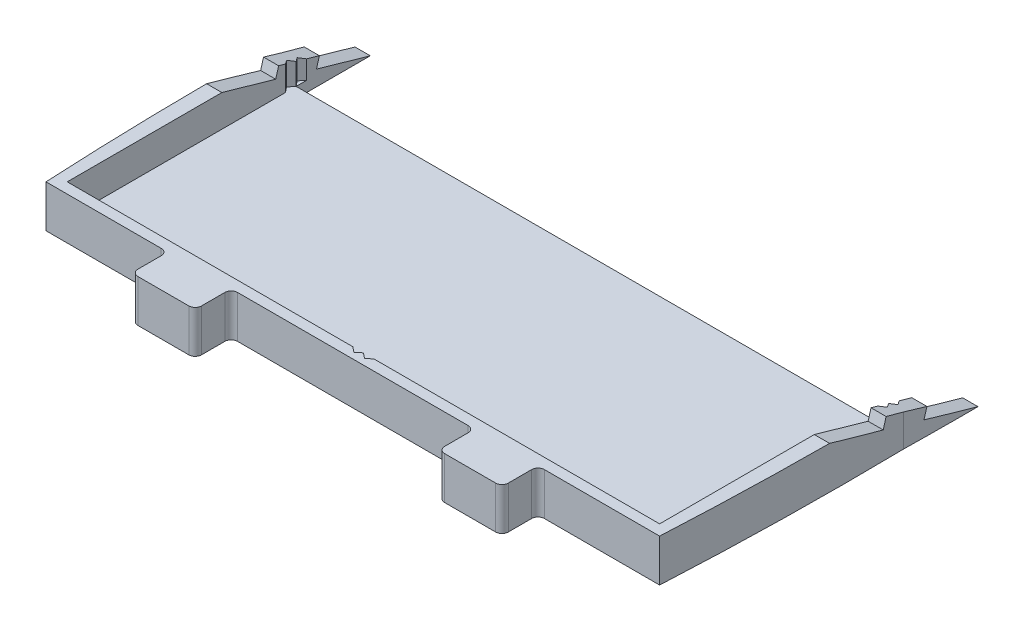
ISO-10303-21;
HEADER;
FILE_DESCRIPTION(('STEP AP214'),'2;1');
FILE_NAME('part.step','',(''),(''),'','','');
FILE_SCHEMA(('AUTOMOTIVE_DESIGN { 1 0 10303 214 1 1 1 1 }'));
ENDSEC;
DATA;
#1=APPLICATION_CONTEXT('core data for automotive mechanical design processes');
#2=APPLICATION_PROTOCOL_DEFINITION('international standard','automotive_design',2000,#1);
#3=PRODUCT_CONTEXT('',#1,'mechanical');
#4=PRODUCT('Part','Part','',(#3));
#5=PRODUCT_RELATED_PRODUCT_CATEGORY('part','',(#4));
#6=PRODUCT_DEFINITION_FORMATION('','',#4);
#7=PRODUCT_DEFINITION_CONTEXT('part definition',#1,'design');
#8=PRODUCT_DEFINITION('design','',#6,#7);
#9=PRODUCT_DEFINITION_SHAPE('','',#8);
#10=(LENGTH_UNIT() NAMED_UNIT(*) SI_UNIT(.MILLI.,.METRE.));
#11=(NAMED_UNIT(*) PLANE_ANGLE_UNIT() SI_UNIT($,.RADIAN.));
#12=(NAMED_UNIT(*) SI_UNIT($,.STERADIAN.) SOLID_ANGLE_UNIT());
#13=UNCERTAINTY_MEASURE_WITH_UNIT(LENGTH_MEASURE(1.E-05),#10,'distance_accuracy_value','');
#14=(GEOMETRIC_REPRESENTATION_CONTEXT(3) GLOBAL_UNCERTAINTY_ASSIGNED_CONTEXT((#13)) GLOBAL_UNIT_ASSIGNED_CONTEXT((#10,
#11,#12)) REPRESENTATION_CONTEXT('',''));
#15=CARTESIAN_POINT('',(0.,0.,0.));
#16=DIRECTION('',(0.,0.,1.));
#17=DIRECTION('',(1.,0.,0.));
#18=AXIS2_PLACEMENT_3D('',#15,#16,#17);
#19=CARTESIAN_POINT('',(0.,5.,0.));
#20=DIRECTION('',(0.,-1.,0.));
#21=DIRECTION('',(0.,0.,-1.));
#22=AXIS2_PLACEMENT_3D('',#19,#20,#21);
#23=PLANE('',#22);
#24=DIRECTION('',(-0.624695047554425,0.,-0.78086880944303));
#25=VECTOR('',#24,1.);
#26=CARTESIAN_POINT('',(-139.7,5.,0.));
#27=LINE('',#26,#25);
#28=CARTESIAN_POINT('',(-139.7,5.,0.));
#29=VERTEX_POINT('',#28);
#30=CARTESIAN_POINT('',(-141.7,5.,-2.5));
#31=VERTEX_POINT('',#30);
#32=EDGE_CURVE('E628',#29,#31,#27,.T.);
#33=ORIENTED_EDGE('',*,*,#32,.F.);
#34=DIRECTION('',(0.,0.,1.));
#35=VECTOR('',#34,1.);
#36=CARTESIAN_POINT('',(-139.7,5.,0.));
#37=LINE('',#36,#35);
#38=CARTESIAN_POINT('',(-139.7,5.,-5.));
#39=VERTEX_POINT('',#38);
#40=EDGE_CURVE('E430',#39,#29,#37,.T.);
#41=ORIENTED_EDGE('',*,*,#40,.F.);
#42=DIRECTION('',(0.624695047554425,0.,-0.78086880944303));
#43=VECTOR('',#42,1.);
#44=CARTESIAN_POINT('',(-141.7,5.,-2.5));
#45=LINE('',#44,#43);
#46=EDGE_CURVE('E622',#31,#39,#45,.T.);
#47=ORIENTED_EDGE('',*,*,#46,.F.);
#48=EDGE_LOOP('',(#33,#41,#47));
#49=FACE_BOUND('',#48,.T.);
#50=ADVANCED_FACE('F102',(#49),#23,.F.);
#51=DIRECTION('',(-0.624695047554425,0.,-0.78086880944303));
#52=VECTOR('',#51,1.);
#53=CARTESIAN_POINT('',(141.7,5.,-2.5));
#54=LINE('',#53,#52);
#55=CARTESIAN_POINT('',(141.7,5.,-2.5));
#56=VERTEX_POINT('',#55);
#57=CARTESIAN_POINT('',(139.7,5.,-5.));
#58=VERTEX_POINT('',#57);
#59=EDGE_CURVE('E642',#56,#58,#54,.T.);
#60=ORIENTED_EDGE('',*,*,#59,.T.);
#61=DIRECTION('',(0.,0.,-1.));
#62=VECTOR('',#61,1.);
#63=CARTESIAN_POINT('',(139.7,5.,0.));
#64=LINE('',#63,#62);
#65=CARTESIAN_POINT('',(139.7,5.,0.));
#66=VERTEX_POINT('',#65);
#67=EDGE_CURVE('E447',#66,#58,#64,.T.);
#68=ORIENTED_EDGE('',*,*,#67,.F.);
#69=DIRECTION('',(0.624695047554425,0.,-0.78086880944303));
#70=VECTOR('',#69,1.);
#71=CARTESIAN_POINT('',(139.7,5.,0.));
#72=LINE('',#71,#70);
#73=EDGE_CURVE('E634',#66,#56,#72,.T.);
#74=ORIENTED_EDGE('',*,*,#73,.T.);
#75=EDGE_LOOP('',(#60,#68,#74));
#76=FACE_BOUND('',#75,.T.);
#77=ADVANCED_FACE('F916',(#76),#23,.F.);
#78=CARTESIAN_POINT('',(-146.922773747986,0.,-35.));
#79=DIRECTION('',(0.,-0.961523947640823,0.274721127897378));
#80=DIRECTION('',(0.,-0.274721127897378,-0.961523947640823));
#81=AXIS2_PLACEMENT_3D('',#78,#79,#80);
#82=PLANE('',#81);
#83=DIRECTION('',(0.,-0.274721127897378,-0.961523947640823));
#84=VECTOR('',#83,1.);
#85=CARTESIAN_POINT('',(-139.7,10.7547169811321,2.64150943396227));
#86=LINE('',#85,#84);
#87=CARTESIAN_POINT('',(-139.7,7.25278872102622,-9.61523947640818));
#88=VERTEX_POINT('',#87);
#89=CARTESIAN_POINT('',(-139.7,0.,-35.));
#90=VERTEX_POINT('',#89);
#91=EDGE_CURVE('E536',#88,#90,#86,.T.);
#92=ORIENTED_EDGE('',*,*,#91,.T.);
#93=DIRECTION('',(1.,0.,0.));
#94=VECTOR('',#93,1.);
#95=CARTESIAN_POINT('',(-146.922773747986,0.,-35.));
#96=LINE('',#95,#94);
#97=CARTESIAN_POINT('',(-146.90706839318,0.,-35.));
#98=VERTEX_POINT('',#97);
#99=EDGE_CURVE('E446',#98,#90,#96,.T.);
#100=ORIENTED_EDGE('',*,*,#99,.F.);
#101=CARTESIAN_POINT('',(1483.47531380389,2.04463886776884,-27.843763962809));
#102=DIRECTION('',(0.,-0.961523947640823,0.274721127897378));
#103=DIRECTION('',(0.,-0.274721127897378,-0.961523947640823));
#104=AXIS2_PLACEMENT_3D('',#101,#102,#103);
#105=ELLIPSE('',#104,1695.6396058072,1630.39808755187);
#106=CARTESIAN_POINT('',(-146.820869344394,7.25278872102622,-9.61523947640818));
#107=VERTEX_POINT('',#106);
#108=EDGE_CURVE('E110',#107,#98,#105,.T.);
#109=ORIENTED_EDGE('',*,*,#108,.F.);
#110=DIRECTION('',(1.,0.,0.));
#111=VECTOR('',#110,1.);
#112=CARTESIAN_POINT('',(-146.922773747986,7.25278872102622,-9.61523947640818));
#113=LINE('',#112,#111);
#114=EDGE_CURVE('E463',#107,#88,#113,.T.);
#115=ORIENTED_EDGE('',*,*,#114,.T.);
#116=EDGE_LOOP('',(#92,#100,#109,#115));
#117=FACE_BOUND('',#116,.T.);
#118=ADVANCED_FACE('F819',(#117),#82,.F.);
#119=CARTESIAN_POINT('',(139.7,20.,0.));
#120=DIRECTION('',(-1.,0.,0.));
#121=DIRECTION('',(0.,0.,1.));
#122=AXIS2_PLACEMENT_3D('',#119,#120,#121);
#123=PLANE('',#122);
#124=DIRECTION('',(0.,0.274721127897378,0.961523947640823));
#125=VECTOR('',#124,1.);
#126=CARTESIAN_POINT('',(139.7,10.7547169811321,2.64150943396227));
#127=LINE('',#126,#125);
#128=CARTESIAN_POINT('',(139.7,0.,-35.));
#129=VERTEX_POINT('',#128);
#130=CARTESIAN_POINT('',(139.7,7.25278872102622,-9.61523947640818));
#131=VERTEX_POINT('',#130);
#132=EDGE_CURVE('E538',#129,#131,#127,.T.);
#133=ORIENTED_EDGE('',*,*,#132,.F.);
#134=DIRECTION('',(0.,0.,-1.));
#135=VECTOR('',#134,1.);
#136=CARTESIAN_POINT('',(139.7,0.,0.));
#137=LINE('',#136,#135);
#138=CARTESIAN_POINT('',(139.7,0.,0.));
#139=VERTEX_POINT('',#138);
#140=EDGE_CURVE('E435',#139,#129,#137,.T.);
#141=ORIENTED_EDGE('',*,*,#140,.F.);
#142=DIRECTION('',(0.,1.,0.));
#143=VECTOR('',#142,1.);
#144=CARTESIAN_POINT('',(139.7,0.,0.));
#145=LINE('',#144,#143);
#146=EDGE_CURVE('E434',#139,#66,#145,.T.);
#147=ORIENTED_EDGE('',*,*,#146,.T.);
#148=ORIENTED_EDGE('',*,*,#67,.T.);
#149=DIRECTION('',(0.,1.,0.));
#150=VECTOR('',#149,1.);
#151=CARTESIAN_POINT('',(139.7,5.,-5.));
#152=LINE('',#151,#150);
#153=CARTESIAN_POINT('',(139.7,13.7715070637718,-5.));
#154=VERTEX_POINT('',#153);
#155=EDGE_CURVE('E646',#58,#154,#152,.T.);
#156=ORIENTED_EDGE('',*,*,#155,.T.);
#157=DIRECTION('',(0.,0.274721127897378,0.961523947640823));
#158=VECTOR('',#157,1.);
#159=CARTESIAN_POINT('',(139.7,15.5623367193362,1.26790379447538));
#160=LINE('',#159,#158);
#161=CARTESIAN_POINT('',(139.7,12.0604084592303,-10.9888451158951));
#162=VERTEX_POINT('',#161);
#163=EDGE_CURVE('E525',#162,#154,#160,.T.);
#164=ORIENTED_EDGE('',*,*,#163,.F.);
#165=DIRECTION('',(0.,0.961523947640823,-0.274721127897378));
#166=VECTOR('',#165,1.);
#167=CARTESIAN_POINT('',(139.7,16.4980717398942,-12.2567489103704));
#168=LINE('',#167,#166);
#169=EDGE_CURVE('E531',#131,#162,#168,.T.);
#170=ORIENTED_EDGE('',*,*,#169,.F.);
#171=EDGE_LOOP('',(#133,#141,#147,#148,#156,#164,#170));
#172=FACE_BOUND('',#171,.T.);
#173=ADVANCED_FACE('F953',(#172),#123,.T.);
#174=DIRECTION('',(0.,0.274721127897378,0.961523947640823));
#175=VECTOR('',#174,1.);
#176=CARTESIAN_POINT('',(139.7,15.5623367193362,1.26790379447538));
#177=LINE('',#176,#175);
#178=CARTESIAN_POINT('',(139.7,16.6286499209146,5.));
#179=VERTEX_POINT('',#178);
#180=CARTESIAN_POINT('',(139.7,17.5548310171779,8.2416338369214));
#181=VERTEX_POINT('',#180);
#182=EDGE_CURVE('E523',#179,#181,#177,.T.);
#183=ORIENTED_EDGE('',*,*,#182,.F.);
#184=DIRECTION('',(0.,1.,0.));
#185=VECTOR('',#184,1.);
#186=CARTESIAN_POINT('',(139.7,5.,5.));
#187=LINE('',#186,#185);
#188=CARTESIAN_POINT('',(139.7,5.,5.));
#189=VERTEX_POINT('',#188);
#190=EDGE_CURVE('E602',#189,#179,#187,.T.);
#191=ORIENTED_EDGE('',*,*,#190,.F.);
#192=DIRECTION('',(0.,0.,-1.));
#193=VECTOR('',#192,1.);
#194=CARTESIAN_POINT('',(139.7,5.,387.394735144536));
#195=LINE('',#194,#193);
#196=CARTESIAN_POINT('',(139.7,5.,107.95));
#197=VERTEX_POINT('',#196);
#198=EDGE_CURVE('E562',#197,#189,#195,.T.);
#199=ORIENTED_EDGE('',*,*,#198,.F.);
#200=DIRECTION('',(0.,-1.,0.));
#201=VECTOR('',#200,1.);
#202=CARTESIAN_POINT('',(139.7,20.,107.95));
#203=LINE('',#202,#201);
#204=CARTESIAN_POINT('',(139.7,20.,107.95));
#205=VERTEX_POINT('',#204);
#206=EDGE_CURVE('E711',#205,#197,#203,.T.);
#207=ORIENTED_EDGE('',*,*,#206,.F.);
#208=DIRECTION('',(0.,0.,-1.));
#209=VECTOR('',#208,1.);
#210=CARTESIAN_POINT('',(139.7,20.,0.));
#211=LINE('',#210,#209);
#212=CARTESIAN_POINT('',(139.7,20.,35.0000000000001));
#213=VERTEX_POINT('',#212);
#214=EDGE_CURVE('E657',#205,#213,#211,.T.);
#215=ORIENTED_EDGE('',*,*,#214,.T.);
#216=DIRECTION('',(0.,0.274721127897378,0.961523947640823));
#217=VECTOR('',#216,1.);
#218=CARTESIAN_POINT('',(139.7,10.7547169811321,2.64150943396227));
#219=LINE('',#218,#217);
#220=CARTESIAN_POINT('',(139.7,12.7472112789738,9.61523947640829));
#221=VERTEX_POINT('',#220);
#222=EDGE_CURVE('E482',#221,#213,#219,.T.);
#223=ORIENTED_EDGE('',*,*,#222,.F.);
#224=DIRECTION('',(0.,-0.961523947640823,0.274721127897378));
#225=VECTOR('',#224,1.);
#226=CARTESIAN_POINT('',(139.7,21.9924942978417,6.97373004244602));
#227=LINE('',#226,#225);
#228=EDGE_CURVE('E489',#181,#221,#227,.T.);
#229=ORIENTED_EDGE('',*,*,#228,.F.);
#230=EDGE_LOOP('',(#183,#191,#199,#207,#215,#223,#229));
#231=FACE_BOUND('',#230,.T.);
#232=ADVANCED_FACE('F971',(#231),#123,.T.);
#233=CARTESIAN_POINT('',(0.,20.,107.95));
#234=DIRECTION('',(0.,0.,1.));
#235=DIRECTION('',(1.,0.,0.));
#236=AXIS2_PLACEMENT_3D('',#233,#234,#235);
#237=PLANE('',#236);
#238=DIRECTION('',(-1.,0.,0.));
#239=VECTOR('',#238,1.);
#240=CARTESIAN_POINT('',(-139.7,5.,107.95));
#241=LINE('',#240,#239);
#242=CARTESIAN_POINT('',(-5.00000000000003,5.,107.95));
#243=VERTEX_POINT('',#242);
#244=CARTESIAN_POINT('',(-139.7,5.,107.95));
#245=VERTEX_POINT('',#244);
#246=EDGE_CURVE('E566',#243,#245,#241,.T.);
#247=ORIENTED_EDGE('',*,*,#246,.T.);
#248=DIRECTION('',(0.,-1.,0.));
#249=VECTOR('',#248,1.);
#250=CARTESIAN_POINT('',(-139.7,20.,107.95));
#251=LINE('',#250,#249);
#252=CARTESIAN_POINT('',(-139.7,20.,107.95));
#253=VERTEX_POINT('',#252);
#254=EDGE_CURVE('E714',#253,#245,#251,.T.);
#255=ORIENTED_EDGE('',*,*,#254,.F.);
#256=DIRECTION('',(-1.,0.,0.));
#257=VECTOR('',#256,1.);
#258=CARTESIAN_POINT('',(0.,20.,107.95));
#259=LINE('',#258,#257);
#260=CARTESIAN_POINT('',(-5.00000000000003,20.,107.95));
#261=VERTEX_POINT('',#260);
#262=EDGE_CURVE('E661',#261,#253,#259,.T.);
#263=ORIENTED_EDGE('',*,*,#262,.F.);
#264=DIRECTION('',(0.,1.,0.));
#265=VECTOR('',#264,1.);
#266=CARTESIAN_POINT('',(-5.00000000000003,5.,107.95));
#267=LINE('',#266,#265);
#268=EDGE_CURVE('E615',#243,#261,#267,.T.);
#269=ORIENTED_EDGE('',*,*,#268,.F.);
#270=EDGE_LOOP('',(#247,#255,#263,#269));
#271=FACE_BOUND('',#270,.T.);
#272=ADVANCED_FACE('F1001',(#271),#237,.F.);
#273=CARTESIAN_POINT('',(5.00000000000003,5.,107.95));
#274=VERTEX_POINT('',#273);
#275=EDGE_CURVE('E563',#197,#274,#241,.T.);
#276=ORIENTED_EDGE('',*,*,#275,.T.);
#277=DIRECTION('',(0.,1.,0.));
#278=VECTOR('',#277,1.);
#279=CARTESIAN_POINT('',(5.00000000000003,5.,107.95));
#280=LINE('',#279,#278);
#281=CARTESIAN_POINT('',(5.00000000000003,20.,107.95));
#282=VERTEX_POINT('',#281);
#283=EDGE_CURVE('E593',#274,#282,#280,.T.);
#284=ORIENTED_EDGE('',*,*,#283,.T.);
#285=EDGE_CURVE('E662',#205,#282,#259,.T.);
#286=ORIENTED_EDGE('',*,*,#285,.F.);
#287=ORIENTED_EDGE('',*,*,#206,.T.);
#288=EDGE_LOOP('',(#276,#284,#286,#287));
#289=FACE_BOUND('',#288,.T.);
#290=ADVANCED_FACE('F978',(#289),#237,.F.);
#291=CARTESIAN_POINT('',(-139.7,20.,0.));
#292=DIRECTION('',(1.,0.,0.));
#293=DIRECTION('',(0.,0.,-1.));
#294=AXIS2_PLACEMENT_3D('',#291,#292,#293);
#295=PLANE('',#294);
#296=DIRECTION('',(0.,-0.274721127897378,-0.961523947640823));
#297=VECTOR('',#296,1.);
#298=CARTESIAN_POINT('',(-139.7,15.5623367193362,1.26790379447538));
#299=LINE('',#298,#297);
#300=CARTESIAN_POINT('',(-139.7,17.5548310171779,8.2416338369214));
#301=VERTEX_POINT('',#300);
#302=CARTESIAN_POINT('',(-139.7,16.6286499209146,5.));
#303=VERTEX_POINT('',#302);
#304=EDGE_CURVE('E507',#301,#303,#299,.T.);
#305=ORIENTED_EDGE('',*,*,#304,.F.);
#306=DIRECTION('',(0.,0.961523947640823,-0.274721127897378));
#307=VECTOR('',#306,1.);
#308=CARTESIAN_POINT('',(-139.7,21.9924942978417,6.97373004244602));
#309=LINE('',#308,#307);
#310=CARTESIAN_POINT('',(-139.7,12.7472112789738,9.61523947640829));
#311=VERTEX_POINT('',#310);
#312=EDGE_CURVE('E487',#311,#301,#309,.T.);
#313=ORIENTED_EDGE('',*,*,#312,.F.);
#314=DIRECTION('',(0.,-0.274721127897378,-0.961523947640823));
#315=VECTOR('',#314,1.);
#316=CARTESIAN_POINT('',(-139.7,10.7547169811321,2.64150943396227));
#317=LINE('',#316,#315);
#318=CARTESIAN_POINT('',(-139.7,20.,35.0000000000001));
#319=VERTEX_POINT('',#318);
#320=EDGE_CURVE('E480',#319,#311,#317,.T.);
#321=ORIENTED_EDGE('',*,*,#320,.F.);
#322=DIRECTION('',(0.,0.,1.));
#323=VECTOR('',#322,1.);
#324=CARTESIAN_POINT('',(-139.7,20.,0.));
#325=LINE('',#324,#323);
#326=EDGE_CURVE('E655',#319,#253,#325,.T.);
#327=ORIENTED_EDGE('',*,*,#326,.T.);
#328=ORIENTED_EDGE('',*,*,#254,.T.);
#329=DIRECTION('',(0.,0.,-1.));
#330=VECTOR('',#329,1.);
#331=CARTESIAN_POINT('',(-139.7,5.,387.394735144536));
#332=LINE('',#331,#330);
#333=CARTESIAN_POINT('',(-139.7,5.,5.));
#334=VERTEX_POINT('',#333);
#335=EDGE_CURVE('E568',#245,#334,#332,.T.);
#336=ORIENTED_EDGE('',*,*,#335,.T.);
#337=DIRECTION('',(0.,1.,0.));
#338=VECTOR('',#337,1.);
#339=CARTESIAN_POINT('',(-139.7,5.,5.));
#340=LINE('',#339,#338);
#341=EDGE_CURVE('E576',#334,#303,#340,.T.);
#342=ORIENTED_EDGE('',*,*,#341,.T.);
#343=EDGE_LOOP('',(#305,#313,#321,#327,#328,#336,#342));
#344=FACE_BOUND('',#343,.T.);
#345=ADVANCED_FACE('F1004',(#344),#295,.T.);
#346=ORIENTED_EDGE('',*,*,#91,.F.);
#347=DIRECTION('',(0.,-0.961523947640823,0.274721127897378));
#348=VECTOR('',#347,1.);
#349=CARTESIAN_POINT('',(-139.7,16.4980717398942,-12.2567489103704));
#350=LINE('',#349,#348);
#351=CARTESIAN_POINT('',(-139.7,12.0604084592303,-10.9888451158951));
#352=VERTEX_POINT('',#351);
#353=EDGE_CURVE('E529',#352,#88,#350,.T.);
#354=ORIENTED_EDGE('',*,*,#353,.F.);
#355=DIRECTION('',(0.,-0.274721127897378,-0.961523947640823));
#356=VECTOR('',#355,1.);
#357=CARTESIAN_POINT('',(-139.7,15.5623367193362,1.26790379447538));
#358=LINE('',#357,#356);
#359=CARTESIAN_POINT('',(-139.7,13.7715070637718,-5.));
#360=VERTEX_POINT('',#359);
#361=EDGE_CURVE('E511',#360,#352,#358,.T.);
#362=ORIENTED_EDGE('',*,*,#361,.F.);
#363=DIRECTION('',(0.,1.,0.));
#364=VECTOR('',#363,1.);
#365=CARTESIAN_POINT('',(-139.7,5.,-5.));
#366=LINE('',#365,#364);
#367=EDGE_CURVE('E630',#39,#360,#366,.T.);
#368=ORIENTED_EDGE('',*,*,#367,.F.);
#369=ORIENTED_EDGE('',*,*,#40,.T.);
#370=DIRECTION('',(0.,1.,0.));
#371=VECTOR('',#370,1.);
#372=CARTESIAN_POINT('',(-139.7,0.,0.));
#373=LINE('',#372,#371);
#374=CARTESIAN_POINT('',(-139.7,0.,0.));
#375=VERTEX_POINT('',#374);
#376=EDGE_CURVE('E422',#375,#29,#373,.T.);
#377=ORIENTED_EDGE('',*,*,#376,.F.);
#378=DIRECTION('',(0.,0.,1.));
#379=VECTOR('',#378,1.);
#380=CARTESIAN_POINT('',(-139.7,0.,0.));
#381=LINE('',#380,#379);
#382=EDGE_CURVE('E427',#90,#375,#381,.T.);
#383=ORIENTED_EDGE('',*,*,#382,.F.);
#384=EDGE_LOOP('',(#346,#354,#362,#368,#369,#377,#383));
#385=FACE_BOUND('',#384,.T.);
#386=ADVANCED_FACE('F425',(#385),#295,.T.);
#387=CARTESIAN_POINT('',(0.,20.,0.));
#388=DIRECTION('',(0.,1.,0.));
#389=DIRECTION('',(0.,0.,1.));
#390=AXIS2_PLACEMENT_3D('',#387,#388,#389);
#391=PLANE('',#390);
#392=DIRECTION('',(1.,0.,0.));
#393=VECTOR('',#392,1.);
#394=CARTESIAN_POINT('',(-146.922773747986,20.,35.0000000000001));
#395=LINE('',#394,#393);
#396=CARTESIAN_POINT('',(-146.90706839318,20.,35.0000000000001));
#397=VERTEX_POINT('',#396);
#398=EDGE_CURVE('E476',#397,#319,#395,.T.);
#399=ORIENTED_EDGE('',*,*,#398,.F.);
#400=CARTESIAN_POINT('',(1483.47531380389,20.,27.8437639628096));
#401=DIRECTION('',(0.,-1.,0.));
#402=DIRECTION('',(0.,0.,1.));
#403=AXIS2_PLACEMENT_3D('',#400,#401,#402);
#404=CIRCLE('',#403,1630.39808755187);
#405=CARTESIAN_POINT('',(-144.7,20.,112.95));
#406=VERTEX_POINT('',#405);
#407=EDGE_CURVE('E541',#406,#397,#404,.T.);
#408=ORIENTED_EDGE('',*,*,#407,.F.);
#409=DIRECTION('',(-1.,0.,0.));
#410=VECTOR('',#409,1.);
#411=CARTESIAN_POINT('',(0.,20.,112.95));
#412=LINE('',#411,#410);
#413=CARTESIAN_POINT('',(-90.35,20.,112.95));
#414=VERTEX_POINT('',#413);
#415=EDGE_CURVE('E665',#414,#406,#412,.T.);
#416=ORIENTED_EDGE('',*,*,#415,.F.);
#417=CARTESIAN_POINT('',(-90.35,20.,115.95));
#418=DIRECTION('',(0.,1.,0.));
#419=DIRECTION('',(0.,0.,1.));
#420=AXIS2_PLACEMENT_3D('',#417,#418,#419);
#421=CIRCLE('',#420,3.);
#422=CARTESIAN_POINT('',(-87.35,20.,115.95));
#423=VERTEX_POINT('',#422);
#424=EDGE_CURVE('E786',#414,#423,#421,.F.);
#425=ORIENTED_EDGE('',*,*,#424,.T.);
#426=DIRECTION('',(0.,0.,-1.));
#427=VECTOR('',#426,1.);
#428=CARTESIAN_POINT('',(-87.35,20.,0.));
#429=LINE('',#428,#427);
#430=CARTESIAN_POINT('',(-87.35,20.,126.95));
#431=VERTEX_POINT('',#430);
#432=EDGE_CURVE('E672',#431,#423,#429,.T.);
#433=ORIENTED_EDGE('',*,*,#432,.F.);
#434=CARTESIAN_POINT('',(-84.35,20.,126.95));
#435=DIRECTION('',(0.,1.,0.));
#436=DIRECTION('',(0.,0.,1.));
#437=AXIS2_PLACEMENT_3D('',#434,#435,#436);
#438=CIRCLE('',#437,3.);
#439=CARTESIAN_POINT('',(-84.35,20.,129.95));
#440=VERTEX_POINT('',#439);
#441=EDGE_CURVE('E726',#431,#440,#438,.T.);
#442=ORIENTED_EDGE('',*,*,#441,.T.);
#443=DIRECTION('',(-1.,0.,0.));
#444=VECTOR('',#443,1.);
#445=CARTESIAN_POINT('',(0.,20.,129.95));
#446=LINE('',#445,#444);
#447=CARTESIAN_POINT('',(-60.35,20.,129.95));
#448=VERTEX_POINT('',#447);
#449=EDGE_CURVE('E675',#448,#440,#446,.T.);
#450=ORIENTED_EDGE('',*,*,#449,.F.);
#451=CARTESIAN_POINT('',(-60.35,20.,126.95));
#452=DIRECTION('',(0.,1.,0.));
#453=DIRECTION('',(0.,0.,1.));
#454=AXIS2_PLACEMENT_3D('',#451,#452,#453);
#455=CIRCLE('',#454,3.);
#456=CARTESIAN_POINT('',(-57.35,20.,126.95));
#457=VERTEX_POINT('',#456);
#458=EDGE_CURVE('E728',#448,#457,#455,.T.);
#459=ORIENTED_EDGE('',*,*,#458,.T.);
#460=DIRECTION('',(0.,0.,1.));
#461=VECTOR('',#460,1.);
#462=CARTESIAN_POINT('',(-57.35,20.,0.));
#463=LINE('',#462,#461);
#464=CARTESIAN_POINT('',(-57.35,20.,115.95));
#465=VERTEX_POINT('',#464);
#466=EDGE_CURVE('E670',#465,#457,#463,.T.);
#467=ORIENTED_EDGE('',*,*,#466,.F.);
#468=CARTESIAN_POINT('',(-54.35,20.,115.95));
#469=DIRECTION('',(0.,1.,0.));
#470=DIRECTION('',(0.,0.,1.));
#471=AXIS2_PLACEMENT_3D('',#468,#469,#470);
#472=CIRCLE('',#471,3.);
#473=CARTESIAN_POINT('',(-54.35,20.,112.95));
#474=VERTEX_POINT('',#473);
#475=EDGE_CURVE('E782',#465,#474,#472,.F.);
#476=ORIENTED_EDGE('',*,*,#475,.T.);
#477=CARTESIAN_POINT('',(54.35,20.,112.95));
#478=VERTEX_POINT('',#477);
#479=EDGE_CURVE('E666',#478,#474,#412,.T.);
#480=ORIENTED_EDGE('',*,*,#479,.F.);
#481=CARTESIAN_POINT('',(54.35,20.,115.95));
#482=DIRECTION('',(0.,1.,0.));
#483=DIRECTION('',(0.,0.,1.));
#484=AXIS2_PLACEMENT_3D('',#481,#482,#483);
#485=CIRCLE('',#484,3.);
#486=CARTESIAN_POINT('',(57.35,20.,115.95));
#487=VERTEX_POINT('',#486);
#488=EDGE_CURVE('E778',#478,#487,#485,.F.);
#489=ORIENTED_EDGE('',*,*,#488,.T.);
#490=DIRECTION('',(0.,0.,1.));
#491=VECTOR('',#490,1.);
#492=CARTESIAN_POINT('',(57.35,20.,0.));
#493=LINE('',#492,#491);
#494=CARTESIAN_POINT('',(57.35,20.,126.95));
#495=VERTEX_POINT('',#494);
#496=EDGE_CURVE('E669',#487,#495,#493,.T.);
#497=ORIENTED_EDGE('',*,*,#496,.T.);
#498=CARTESIAN_POINT('',(60.35,20.,126.95));
#499=DIRECTION('',(0.,1.,0.));
#500=DIRECTION('',(0.,0.,1.));
#501=AXIS2_PLACEMENT_3D('',#498,#499,#500);
#502=CIRCLE('',#501,3.);
#503=CARTESIAN_POINT('',(60.35,20.,129.95));
#504=VERTEX_POINT('',#503);
#505=EDGE_CURVE('E730',#495,#504,#502,.T.);
#506=ORIENTED_EDGE('',*,*,#505,.T.);
#507=DIRECTION('',(1.,0.,0.));
#508=VECTOR('',#507,1.);
#509=CARTESIAN_POINT('',(0.,20.,129.95));
#510=LINE('',#509,#508);
#511=CARTESIAN_POINT('',(84.35,20.,129.95));
#512=VERTEX_POINT('',#511);
#513=EDGE_CURVE('E682',#504,#512,#510,.T.);
#514=ORIENTED_EDGE('',*,*,#513,.T.);
#515=CARTESIAN_POINT('',(84.35,20.,126.95));
#516=DIRECTION('',(0.,1.,0.));
#517=DIRECTION('',(0.,0.,1.));
#518=AXIS2_PLACEMENT_3D('',#515,#516,#517);
#519=CIRCLE('',#518,3.);
#520=CARTESIAN_POINT('',(87.35,20.,126.95));
#521=VERTEX_POINT('',#520);
#522=EDGE_CURVE('E732',#512,#521,#519,.T.);
#523=ORIENTED_EDGE('',*,*,#522,.T.);
#524=DIRECTION('',(0.,0.,-1.));
#525=VECTOR('',#524,1.);
#526=CARTESIAN_POINT('',(87.35,20.,0.));
#527=LINE('',#526,#525);
#528=CARTESIAN_POINT('',(87.35,20.,115.95));
#529=VERTEX_POINT('',#528);
#530=EDGE_CURVE('E685',#521,#529,#527,.T.);
#531=ORIENTED_EDGE('',*,*,#530,.T.);
#532=CARTESIAN_POINT('',(90.35,20.,115.95));
#533=DIRECTION('',(0.,1.,0.));
#534=DIRECTION('',(0.,0.,1.));
#535=AXIS2_PLACEMENT_3D('',#532,#533,#534);
#536=CIRCLE('',#535,3.);
#537=CARTESIAN_POINT('',(90.35,20.,112.95));
#538=VERTEX_POINT('',#537);
#539=EDGE_CURVE('E117',#529,#538,#536,.F.);
#540=ORIENTED_EDGE('',*,*,#539,.T.);
#541=CARTESIAN_POINT('',(144.7,20.,112.95));
#542=VERTEX_POINT('',#541);
#543=EDGE_CURVE('E671',#542,#538,#412,.T.);
#544=ORIENTED_EDGE('',*,*,#543,.F.);
#545=CARTESIAN_POINT('',(-1483.47531380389,20.,27.8437639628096));
#546=DIRECTION('',(0.,1.,0.));
#547=DIRECTION('',(0.,0.,1.));
#548=AXIS2_PLACEMENT_3D('',#545,#546,#547);
#549=CIRCLE('',#548,1630.39808755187);
#550=CARTESIAN_POINT('',(146.90706839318,20.,35.0000000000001));
#551=VERTEX_POINT('',#550);
#552=EDGE_CURVE('E552',#542,#551,#549,.T.);
#553=ORIENTED_EDGE('',*,*,#552,.T.);
#554=EDGE_CURVE('E455',#213,#551,#395,.T.);
#555=ORIENTED_EDGE('',*,*,#554,.F.);
#556=ORIENTED_EDGE('',*,*,#214,.F.);
#557=ORIENTED_EDGE('',*,*,#285,.T.);
#558=DIRECTION('',(0.78086880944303,0.,-0.624695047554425));
#559=VECTOR('',#558,1.);
#560=CARTESIAN_POINT('',(5.00000000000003,20.,107.95));
#561=LINE('',#560,#559);
#562=CARTESIAN_POINT('',(2.50000000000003,20.,109.95));
#563=VERTEX_POINT('',#562);
#564=EDGE_CURVE('E586',#563,#282,#561,.T.);
#565=ORIENTED_EDGE('',*,*,#564,.F.);
#566=DIRECTION('',(0.78086880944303,0.,0.624695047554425));
#567=VECTOR('',#566,1.);
#568=CARTESIAN_POINT('',(2.50000000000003,20.,109.95));
#569=LINE('',#568,#567);
#570=CARTESIAN_POINT('',(0.,20.,107.95));
#571=VERTEX_POINT('',#570);
#572=EDGE_CURVE('E579',#571,#563,#569,.T.);
#573=ORIENTED_EDGE('',*,*,#572,.F.);
#574=DIRECTION('',(-0.78086880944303,0.,0.624695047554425));
#575=VECTOR('',#574,1.);
#576=CARTESIAN_POINT('',(-2.50000000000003,20.,109.95));
#577=LINE('',#576,#575);
#578=CARTESIAN_POINT('',(-2.50000000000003,20.,109.95));
#579=VERTEX_POINT('',#578);
#580=EDGE_CURVE('E613',#571,#579,#577,.T.);
#581=ORIENTED_EDGE('',*,*,#580,.T.);
#582=DIRECTION('',(-0.78086880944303,0.,-0.624695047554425));
#583=VECTOR('',#582,1.);
#584=CARTESIAN_POINT('',(-5.00000000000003,20.,107.95));
#585=LINE('',#584,#583);
#586=EDGE_CURVE('E606',#579,#261,#585,.T.);
#587=ORIENTED_EDGE('',*,*,#586,.T.);
#588=ORIENTED_EDGE('',*,*,#262,.T.);
#589=ORIENTED_EDGE('',*,*,#326,.F.);
#590=EDGE_LOOP('',(#399,#408,#416,#425,#433,#442,#450,#459,#467,#476,#480,#489,#497,#506,#514,
#523,#531,#540,#544,#553,#555,#556,#557,#565,#573,#581,#587,#588,#589));
#591=FACE_BOUND('',#590,.T.);
#592=ADVANCED_FACE('F853',(#591),#391,.T.);
#593=CARTESIAN_POINT('',(0.,20.,112.95));
#594=DIRECTION('',(0.,0.,1.));
#595=DIRECTION('',(1.,0.,0.));
#596=AXIS2_PLACEMENT_3D('',#593,#594,#595);
#597=PLANE('',#596);
#598=DIRECTION('',(-1.,0.,0.));
#599=VECTOR('',#598,1.);
#600=CARTESIAN_POINT('',(0.,0.,112.95));
#601=LINE('',#600,#599);
#602=CARTESIAN_POINT('',(-90.35,0.,112.95));
#603=VERTEX_POINT('',#602);
#604=CARTESIAN_POINT('',(-144.7,0.,112.95));
#605=VERTEX_POINT('',#604);
#606=EDGE_CURVE('E649',#603,#605,#601,.T.);
#607=ORIENTED_EDGE('',*,*,#606,.F.);
#608=DIRECTION('',(0.,-1.,0.));
#609=VECTOR('',#608,1.);
#610=CARTESIAN_POINT('',(-90.35,20.,112.95));
#611=LINE('',#610,#609);
#612=EDGE_CURVE('E771',#603,#414,#611,.F.);
#613=ORIENTED_EDGE('',*,*,#612,.T.);
#614=ORIENTED_EDGE('',*,*,#415,.T.);
#615=DIRECTION('',(0.,-1.,0.));
#616=VECTOR('',#615,1.);
#617=CARTESIAN_POINT('',(-144.7,20.,112.95));
#618=LINE('',#617,#616);
#619=EDGE_CURVE('E710',#406,#605,#618,.T.);
#620=ORIENTED_EDGE('',*,*,#619,.T.);
#621=EDGE_LOOP('',(#607,#613,#614,#620));
#622=FACE_BOUND('',#621,.T.);
#623=ADVANCED_FACE('F877',(#622),#597,.T.);
#624=CARTESIAN_POINT('',(-87.35,20.,0.));
#625=DIRECTION('',(-1.,0.,0.));
#626=DIRECTION('',(0.,0.,1.));
#627=AXIS2_PLACEMENT_3D('',#624,#625,#626);
#628=PLANE('',#627);
#629=DIRECTION('',(0.,0.,-1.));
#630=VECTOR('',#629,1.);
#631=CARTESIAN_POINT('',(-87.35,0.,0.));
#632=LINE('',#631,#630);
#633=CARTESIAN_POINT('',(-87.35,0.,126.95));
#634=VERTEX_POINT('',#633);
#635=CARTESIAN_POINT('',(-87.35,0.,115.95));
#636=VERTEX_POINT('',#635);
#637=EDGE_CURVE('E689',#634,#636,#632,.T.);
#638=ORIENTED_EDGE('',*,*,#637,.F.);
#639=DIRECTION('',(0.,-1.,0.));
#640=VECTOR('',#639,1.);
#641=CARTESIAN_POINT('',(-87.35,20.,126.95));
#642=LINE('',#641,#640);
#643=EDGE_CURVE('E769',#634,#431,#642,.F.);
#644=ORIENTED_EDGE('',*,*,#643,.T.);
#645=ORIENTED_EDGE('',*,*,#432,.T.);
#646=DIRECTION('',(0.,-1.,0.));
#647=VECTOR('',#646,1.);
#648=CARTESIAN_POINT('',(-87.35,0.,115.95));
#649=LINE('',#648,#647);
#650=EDGE_CURVE('E766',#423,#636,#649,.T.);
#651=ORIENTED_EDGE('',*,*,#650,.T.);
#652=EDGE_LOOP('',(#638,#644,#645,#651));
#653=FACE_BOUND('',#652,.T.);
#654=ADVANCED_FACE('F885',(#653),#628,.T.);
#655=CARTESIAN_POINT('',(0.,20.,129.95));
#656=DIRECTION('',(0.,0.,1.));
#657=DIRECTION('',(1.,0.,0.));
#658=AXIS2_PLACEMENT_3D('',#655,#656,#657);
#659=PLANE('',#658);
#660=DIRECTION('',(-1.,0.,0.));
#661=VECTOR('',#660,1.);
#662=CARTESIAN_POINT('',(0.,0.,129.95));
#663=LINE('',#662,#661);
#664=CARTESIAN_POINT('',(-60.35,0.,129.95));
#665=VERTEX_POINT('',#664);
#666=CARTESIAN_POINT('',(-84.35,0.,129.95));
#667=VERTEX_POINT('',#666);
#668=EDGE_CURVE('E693',#665,#667,#663,.T.);
#669=ORIENTED_EDGE('',*,*,#668,.F.);
#670=DIRECTION('',(0.,-1.,0.));
#671=VECTOR('',#670,1.);
#672=CARTESIAN_POINT('',(-60.35,20.,129.95));
#673=LINE('',#672,#671);
#674=EDGE_CURVE('E764',#665,#448,#673,.F.);
#675=ORIENTED_EDGE('',*,*,#674,.T.);
#676=ORIENTED_EDGE('',*,*,#449,.T.);
#677=DIRECTION('',(0.,-1.,0.));
#678=VECTOR('',#677,1.);
#679=CARTESIAN_POINT('',(-84.35,20.,129.95));
#680=LINE('',#679,#678);
#681=EDGE_CURVE('E761',#440,#667,#680,.T.);
#682=ORIENTED_EDGE('',*,*,#681,.T.);
#683=EDGE_LOOP('',(#669,#675,#676,#682));
#684=FACE_BOUND('',#683,.T.);
#685=ADVANCED_FACE('F893',(#684),#659,.T.);
#686=CARTESIAN_POINT('',(-57.35,20.,0.));
#687=DIRECTION('',(1.,0.,0.));
#688=DIRECTION('',(0.,0.,-1.));
#689=AXIS2_PLACEMENT_3D('',#686,#687,#688);
#690=PLANE('',#689);
#691=DIRECTION('',(0.,0.,1.));
#692=VECTOR('',#691,1.);
#693=CARTESIAN_POINT('',(-57.35,0.,0.));
#694=LINE('',#693,#692);
#695=CARTESIAN_POINT('',(-57.35,0.,115.95));
#696=VERTEX_POINT('',#695);
#697=CARTESIAN_POINT('',(-57.35,0.,126.95));
#698=VERTEX_POINT('',#697);
#699=EDGE_CURVE('E696',#696,#698,#694,.T.);
#700=ORIENTED_EDGE('',*,*,#699,.F.);
#701=DIRECTION('',(0.,-1.,0.));
#702=VECTOR('',#701,1.);
#703=CARTESIAN_POINT('',(-57.35,20.,115.95));
#704=LINE('',#703,#702);
#705=EDGE_CURVE('E759',#696,#465,#704,.F.);
#706=ORIENTED_EDGE('',*,*,#705,.T.);
#707=ORIENTED_EDGE('',*,*,#466,.T.);
#708=DIRECTION('',(0.,-1.,0.));
#709=VECTOR('',#708,1.);
#710=CARTESIAN_POINT('',(-57.35,20.,126.95));
#711=LINE('',#710,#709);
#712=EDGE_CURVE('E756',#457,#698,#711,.T.);
#713=ORIENTED_EDGE('',*,*,#712,.T.);
#714=EDGE_LOOP('',(#700,#706,#707,#713));
#715=FACE_BOUND('',#714,.T.);
#716=ADVANCED_FACE('F902',(#715),#690,.T.);
#717=CARTESIAN_POINT('',(54.35,0.,112.95));
#718=VERTEX_POINT('',#717);
#719=CARTESIAN_POINT('',(-54.35,0.,112.95));
#720=VERTEX_POINT('',#719);
#721=EDGE_CURVE('E690',#718,#720,#601,.T.);
#722=ORIENTED_EDGE('',*,*,#721,.F.);
#723=DIRECTION('',(0.,-1.,0.));
#724=VECTOR('',#723,1.);
#725=CARTESIAN_POINT('',(54.35,20.,112.95));
#726=LINE('',#725,#724);
#727=EDGE_CURVE('E754',#718,#478,#726,.F.);
#728=ORIENTED_EDGE('',*,*,#727,.T.);
#729=ORIENTED_EDGE('',*,*,#479,.T.);
#730=DIRECTION('',(0.,-1.,0.));
#731=VECTOR('',#730,1.);
#732=CARTESIAN_POINT('',(-54.35,0.,112.95));
#733=LINE('',#732,#731);
#734=EDGE_CURVE('E751',#474,#720,#733,.T.);
#735=ORIENTED_EDGE('',*,*,#734,.T.);
#736=EDGE_LOOP('',(#722,#728,#729,#735));
#737=FACE_BOUND('',#736,.T.);
#738=ADVANCED_FACE('F844',(#737),#597,.T.);
#739=CARTESIAN_POINT('',(57.35,20.,0.));
#740=DIRECTION('',(1.,0.,0.));
#741=DIRECTION('',(0.,0.,-1.));
#742=AXIS2_PLACEMENT_3D('',#739,#740,#741);
#743=PLANE('',#742);
#744=DIRECTION('',(0.,0.,1.));
#745=VECTOR('',#744,1.);
#746=CARTESIAN_POINT('',(57.35,0.,0.));
#747=LINE('',#746,#745);
#748=CARTESIAN_POINT('',(57.35,0.,115.95));
#749=VERTEX_POINT('',#748);
#750=CARTESIAN_POINT('',(57.35,0.,126.95));
#751=VERTEX_POINT('',#750);
#752=EDGE_CURVE('E699',#749,#751,#747,.T.);
#753=ORIENTED_EDGE('',*,*,#752,.T.);
#754=DIRECTION('',(0.,-1.,0.));
#755=VECTOR('',#754,1.);
#756=CARTESIAN_POINT('',(57.35,20.,126.95));
#757=LINE('',#756,#755);
#758=EDGE_CURVE('E749',#751,#495,#757,.F.);
#759=ORIENTED_EDGE('',*,*,#758,.T.);
#760=ORIENTED_EDGE('',*,*,#496,.F.);
#761=DIRECTION('',(0.,-1.,0.));
#762=VECTOR('',#761,1.);
#763=CARTESIAN_POINT('',(57.35,20.,115.95));
#764=LINE('',#763,#762);
#765=EDGE_CURVE('E746',#487,#749,#764,.T.);
#766=ORIENTED_EDGE('',*,*,#765,.T.);
#767=EDGE_LOOP('',(#753,#759,#760,#766));
#768=FACE_BOUND('',#767,.T.);
#769=ADVANCED_FACE('F856',(#768),#743,.F.);
#770=CARTESIAN_POINT('',(0.,20.,129.95));
#771=DIRECTION('',(0.,0.,-1.));
#772=DIRECTION('',(-1.,0.,0.));
#773=AXIS2_PLACEMENT_3D('',#770,#771,#772);
#774=PLANE('',#773);
#775=DIRECTION('',(1.,0.,0.));
#776=VECTOR('',#775,1.);
#777=CARTESIAN_POINT('',(0.,0.,129.95));
#778=LINE('',#777,#776);
#779=CARTESIAN_POINT('',(60.35,0.,129.95));
#780=VERTEX_POINT('',#779);
#781=CARTESIAN_POINT('',(84.35,0.,129.95));
#782=VERTEX_POINT('',#781);
#783=EDGE_CURVE('E702',#780,#782,#778,.T.);
#784=ORIENTED_EDGE('',*,*,#783,.T.);
#785=DIRECTION('',(0.,-1.,0.));
#786=VECTOR('',#785,1.);
#787=CARTESIAN_POINT('',(84.35,20.,129.95));
#788=LINE('',#787,#786);
#789=EDGE_CURVE('E744',#782,#512,#788,.F.);
#790=ORIENTED_EDGE('',*,*,#789,.T.);
#791=ORIENTED_EDGE('',*,*,#513,.F.);
#792=DIRECTION('',(0.,-1.,0.));
#793=VECTOR('',#792,1.);
#794=CARTESIAN_POINT('',(60.35,20.,129.95));
#795=LINE('',#794,#793);
#796=EDGE_CURVE('E741',#504,#780,#795,.T.);
#797=ORIENTED_EDGE('',*,*,#796,.T.);
#798=EDGE_LOOP('',(#784,#790,#791,#797));
#799=FACE_BOUND('',#798,.T.);
#800=ADVANCED_FACE('F864',(#799),#774,.F.);
#801=CARTESIAN_POINT('',(87.35,20.,0.));
#802=DIRECTION('',(-1.,0.,0.));
#803=DIRECTION('',(0.,0.,1.));
#804=AXIS2_PLACEMENT_3D('',#801,#802,#803);
#805=PLANE('',#804);
#806=DIRECTION('',(0.,0.,-1.));
#807=VECTOR('',#806,1.);
#808=CARTESIAN_POINT('',(87.35,0.,0.));
#809=LINE('',#808,#807);
#810=CARTESIAN_POINT('',(87.35,0.,126.95));
#811=VERTEX_POINT('',#810);
#812=CARTESIAN_POINT('',(87.35,0.,115.95));
#813=VERTEX_POINT('',#812);
#814=EDGE_CURVE('E705',#811,#813,#809,.T.);
#815=ORIENTED_EDGE('',*,*,#814,.T.);
#816=DIRECTION('',(0.,-1.,0.));
#817=VECTOR('',#816,1.);
#818=CARTESIAN_POINT('',(87.35,20.,115.95));
#819=LINE('',#818,#817);
#820=EDGE_CURVE('E125',#813,#529,#819,.F.);
#821=ORIENTED_EDGE('',*,*,#820,.T.);
#822=ORIENTED_EDGE('',*,*,#530,.F.);
#823=DIRECTION('',(0.,-1.,0.));
#824=VECTOR('',#823,1.);
#825=CARTESIAN_POINT('',(87.35,20.,126.95));
#826=LINE('',#825,#824);
#827=EDGE_CURVE('E737',#521,#811,#826,.T.);
#828=ORIENTED_EDGE('',*,*,#827,.T.);
#829=EDGE_LOOP('',(#815,#821,#822,#828));
#830=FACE_BOUND('',#829,.T.);
#831=ADVANCED_FACE('F870',(#830),#805,.F.);
#832=ORIENTED_EDGE('',*,*,#543,.T.);
#833=DIRECTION('',(0.,-1.,0.));
#834=VECTOR('',#833,1.);
#835=CARTESIAN_POINT('',(90.35,20.,112.95));
#836=LINE('',#835,#834);
#837=CARTESIAN_POINT('',(90.35,0.,112.95));
#838=VERTEX_POINT('',#837);
#839=EDGE_CURVE('E734',#538,#838,#836,.T.);
#840=ORIENTED_EDGE('',*,*,#839,.T.);
#841=CARTESIAN_POINT('',(144.7,0.,112.95));
#842=VERTEX_POINT('',#841);
#843=EDGE_CURVE('E658',#842,#838,#601,.T.);
#844=ORIENTED_EDGE('',*,*,#843,.F.);
#845=DIRECTION('',(0.,-1.,0.));
#846=VECTOR('',#845,1.);
#847=CARTESIAN_POINT('',(144.7,20.,112.95));
#848=LINE('',#847,#846);
#849=EDGE_CURVE('E707',#542,#842,#848,.T.);
#850=ORIENTED_EDGE('',*,*,#849,.F.);
#851=EDGE_LOOP('',(#832,#840,#844,#850));
#852=FACE_BOUND('',#851,.T.);
#853=ADVANCED_FACE('F874',(#852),#597,.T.);
#854=CARTESIAN_POINT('',(0.,0.,0.));
#855=DIRECTION('',(0.,1.,0.));
#856=DIRECTION('',(0.,0.,1.));
#857=AXIS2_PLACEMENT_3D('',#854,#855,#856);
#858=PLANE('',#857);
#859=ORIENTED_EDGE('',*,*,#99,.T.);
#860=ORIENTED_EDGE('',*,*,#382,.T.);
#861=DIRECTION('',(1.,0.,0.));
#862=VECTOR('',#861,1.);
#863=CARTESIAN_POINT('',(-139.7,0.,0.));
#864=LINE('',#863,#862);
#865=EDGE_CURVE('E438',#375,#139,#864,.T.);
#866=ORIENTED_EDGE('',*,*,#865,.T.);
#867=ORIENTED_EDGE('',*,*,#140,.T.);
#868=CARTESIAN_POINT('',(146.90706839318,0.,-35.));
#869=VERTEX_POINT('',#868);
#870=EDGE_CURVE('E459',#129,#869,#96,.T.);
#871=ORIENTED_EDGE('',*,*,#870,.T.);
#872=CARTESIAN_POINT('',(-1483.47531380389,0.,-27.843763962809));
#873=DIRECTION('',(0.,-1.,0.));
#874=DIRECTION('',(0.,0.,-1.));
#875=AXIS2_PLACEMENT_3D('',#872,#873,#874);
#876=CIRCLE('',#875,1630.39808755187);
#877=CARTESIAN_POINT('',(146.685,0.,0.));
#878=VERTEX_POINT('',#877);
#879=EDGE_CURVE('E551',#869,#878,#876,.T.);
#880=ORIENTED_EDGE('',*,*,#879,.T.);
#881=CARTESIAN_POINT('',(-1483.47531380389,0.,27.8437639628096));
#882=DIRECTION('',(0.,1.,0.));
#883=DIRECTION('',(0.,0.,1.));
#884=AXIS2_PLACEMENT_3D('',#881,#882,#883);
#885=CIRCLE('',#884,1630.39808755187);
#886=EDGE_CURVE('E556',#842,#878,#885,.T.);
#887=ORIENTED_EDGE('',*,*,#886,.F.);
#888=ORIENTED_EDGE('',*,*,#843,.T.);
#889=CARTESIAN_POINT('',(90.35,0.,115.95));
#890=DIRECTION('',(0.,1.,0.));
#891=DIRECTION('',(0.,0.,1.));
#892=AXIS2_PLACEMENT_3D('',#889,#890,#891);
#893=CIRCLE('',#892,3.);
#894=EDGE_CURVE('E773',#838,#813,#893,.T.);
#895=ORIENTED_EDGE('',*,*,#894,.T.);
#896=ORIENTED_EDGE('',*,*,#814,.F.);
#897=CARTESIAN_POINT('',(84.35,0.,126.95));
#898=DIRECTION('',(0.,1.,0.));
#899=DIRECTION('',(0.,0.,1.));
#900=AXIS2_PLACEMENT_3D('',#897,#898,#899);
#901=CIRCLE('',#900,3.);
#902=EDGE_CURVE('E724',#811,#782,#901,.F.);
#903=ORIENTED_EDGE('',*,*,#902,.T.);
#904=ORIENTED_EDGE('',*,*,#783,.F.);
#905=CARTESIAN_POINT('',(60.35,0.,126.95));
#906=DIRECTION('',(0.,1.,0.));
#907=DIRECTION('',(0.,0.,1.));
#908=AXIS2_PLACEMENT_3D('',#905,#906,#907);
#909=CIRCLE('',#908,3.);
#910=EDGE_CURVE('E722',#780,#751,#909,.F.);
#911=ORIENTED_EDGE('',*,*,#910,.T.);
#912=ORIENTED_EDGE('',*,*,#752,.F.);
#913=CARTESIAN_POINT('',(54.35,0.,115.95));
#914=DIRECTION('',(0.,1.,0.));
#915=DIRECTION('',(0.,0.,1.));
#916=AXIS2_PLACEMENT_3D('',#913,#914,#915);
#917=CIRCLE('',#916,3.);
#918=EDGE_CURVE('E776',#749,#718,#917,.T.);
#919=ORIENTED_EDGE('',*,*,#918,.T.);
#920=ORIENTED_EDGE('',*,*,#721,.T.);
#921=CARTESIAN_POINT('',(-54.35,0.,115.95));
#922=DIRECTION('',(0.,1.,0.));
#923=DIRECTION('',(0.,0.,1.));
#924=AXIS2_PLACEMENT_3D('',#921,#922,#923);
#925=CIRCLE('',#924,3.);
#926=EDGE_CURVE('E780',#720,#696,#925,.T.);
#927=ORIENTED_EDGE('',*,*,#926,.T.);
#928=ORIENTED_EDGE('',*,*,#699,.T.);
#929=CARTESIAN_POINT('',(-60.35,0.,126.95));
#930=DIRECTION('',(0.,1.,0.));
#931=DIRECTION('',(0.,0.,1.));
#932=AXIS2_PLACEMENT_3D('',#929,#930,#931);
#933=CIRCLE('',#932,3.);
#934=EDGE_CURVE('E720',#698,#665,#933,.F.);
#935=ORIENTED_EDGE('',*,*,#934,.T.);
#936=ORIENTED_EDGE('',*,*,#668,.T.);
#937=CARTESIAN_POINT('',(-84.35,0.,126.95));
#938=DIRECTION('',(0.,1.,0.));
#939=DIRECTION('',(0.,0.,1.));
#940=AXIS2_PLACEMENT_3D('',#937,#938,#939);
#941=CIRCLE('',#940,3.);
#942=EDGE_CURVE('E713',#667,#634,#941,.F.);
#943=ORIENTED_EDGE('',*,*,#942,.T.);
#944=ORIENTED_EDGE('',*,*,#637,.T.);
#945=CARTESIAN_POINT('',(-90.35,0.,115.95));
#946=DIRECTION('',(0.,1.,0.));
#947=DIRECTION('',(0.,0.,1.));
#948=AXIS2_PLACEMENT_3D('',#945,#946,#947);
#949=CIRCLE('',#948,3.);
#950=EDGE_CURVE('E784',#636,#603,#949,.T.);
#951=ORIENTED_EDGE('',*,*,#950,.T.);
#952=ORIENTED_EDGE('',*,*,#606,.T.);
#953=CARTESIAN_POINT('',(1483.47531380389,0.,27.8437639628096));
#954=DIRECTION('',(0.,-1.,0.));
#955=DIRECTION('',(0.,0.,1.));
#956=AXIS2_PLACEMENT_3D('',#953,#954,#955);
#957=CIRCLE('',#956,1630.39808755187);
#958=CARTESIAN_POINT('',(-146.685,0.,0.));
#959=VERTEX_POINT('',#958);
#960=EDGE_CURVE('E545',#605,#959,#957,.T.);
#961=ORIENTED_EDGE('',*,*,#960,.T.);
#962=CARTESIAN_POINT('',(1483.47531380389,0.,-27.843763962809));
#963=DIRECTION('',(0.,1.,0.));
#964=DIRECTION('',(0.,0.,-1.));
#965=AXIS2_PLACEMENT_3D('',#962,#963,#964);
#966=CIRCLE('',#965,1630.39808755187);
#967=EDGE_CURVE('E540',#98,#959,#966,.T.);
#968=ORIENTED_EDGE('',*,*,#967,.F.);
#969=EDGE_LOOP('',(#859,#860,#866,#867,#871,#880,#887,#888,#895,#896,#903,#904,#911,#912,#919,
#920,#927,#928,#935,#936,#943,#944,#951,#952,#961,#968));
#970=FACE_BOUND('',#969,.T.);
#971=ADVANCED_FACE('F444',(#970),#858,.F.);
#972=DIRECTION('',(0.624695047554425,0.,0.78086880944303));
#973=VECTOR('',#972,1.);
#974=CARTESIAN_POINT('',(139.7,5.,0.));
#975=LINE('',#974,#973);
#976=CARTESIAN_POINT('',(141.7,5.,2.5));
#977=VERTEX_POINT('',#976);
#978=EDGE_CURVE('E600',#66,#977,#975,.T.);
#979=ORIENTED_EDGE('',*,*,#978,.F.);
#980=DIRECTION('',(1.,0.,0.));
#981=VECTOR('',#980,1.);
#982=CARTESIAN_POINT('',(-139.7,5.,0.));
#983=LINE('',#982,#981);
#984=EDGE_CURVE('E449',#29,#66,#983,.T.);
#985=ORIENTED_EDGE('',*,*,#984,.F.);
#986=DIRECTION('',(-0.624695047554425,0.,0.78086880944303));
#987=VECTOR('',#986,1.);
#988=CARTESIAN_POINT('',(-139.7,5.,0.));
#989=LINE('',#988,#987);
#990=CARTESIAN_POINT('',(-141.7,5.,2.5));
#991=VERTEX_POINT('',#990);
#992=EDGE_CURVE('E565',#29,#991,#989,.T.);
#993=ORIENTED_EDGE('',*,*,#992,.T.);
#994=DIRECTION('',(0.624695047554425,0.,0.78086880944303));
#995=VECTOR('',#994,1.);
#996=CARTESIAN_POINT('',(-141.7,5.,2.5));
#997=LINE('',#996,#995);
#998=EDGE_CURVE('E572',#991,#334,#997,.T.);
#999=ORIENTED_EDGE('',*,*,#998,.T.);
#1000=ORIENTED_EDGE('',*,*,#335,.F.);
#1001=ORIENTED_EDGE('',*,*,#246,.F.);
#1002=DIRECTION('',(-0.78086880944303,0.,-0.624695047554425));
#1003=VECTOR('',#1002,1.);
#1004=CARTESIAN_POINT('',(-5.00000000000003,5.,107.95));
#1005=LINE('',#1004,#1003);
#1006=CARTESIAN_POINT('',(-2.50000000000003,5.,109.95));
#1007=VERTEX_POINT('',#1006);
#1008=EDGE_CURVE('E609',#1007,#243,#1005,.T.);
#1009=ORIENTED_EDGE('',*,*,#1008,.F.);
#1010=DIRECTION('',(-0.78086880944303,0.,0.624695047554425));
#1011=VECTOR('',#1010,1.);
#1012=CARTESIAN_POINT('',(-2.50000000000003,5.,109.95));
#1013=LINE('',#1012,#1011);
#1014=CARTESIAN_POINT('',(0.,5.,107.95));
#1015=VERTEX_POINT('',#1014);
#1016=EDGE_CURVE('E612',#1015,#1007,#1013,.T.);
#1017=ORIENTED_EDGE('',*,*,#1016,.F.);
#1018=DIRECTION('',(0.78086880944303,0.,0.624695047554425));
#1019=VECTOR('',#1018,1.);
#1020=CARTESIAN_POINT('',(2.50000000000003,5.,109.95));
#1021=LINE('',#1020,#1019);
#1022=CARTESIAN_POINT('',(2.50000000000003,5.,109.95));
#1023=VERTEX_POINT('',#1022);
#1024=EDGE_CURVE('E582',#1015,#1023,#1021,.T.);
#1025=ORIENTED_EDGE('',*,*,#1024,.T.);
#1026=DIRECTION('',(0.78086880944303,0.,-0.624695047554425));
#1027=VECTOR('',#1026,1.);
#1028=CARTESIAN_POINT('',(5.00000000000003,5.,107.95));
#1029=LINE('',#1028,#1027);
#1030=EDGE_CURVE('E585',#1023,#274,#1029,.T.);
#1031=ORIENTED_EDGE('',*,*,#1030,.T.);
#1032=ORIENTED_EDGE('',*,*,#275,.F.);
#1033=ORIENTED_EDGE('',*,*,#198,.T.);
#1034=DIRECTION('',(-0.624695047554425,0.,0.78086880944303));
#1035=VECTOR('',#1034,1.);
#1036=CARTESIAN_POINT('',(141.7,5.,2.5));
#1037=LINE('',#1036,#1035);
#1038=EDGE_CURVE('E596',#977,#189,#1037,.T.);
#1039=ORIENTED_EDGE('',*,*,#1038,.F.);
#1040=EDGE_LOOP('',(#979,#985,#993,#999,#1000,#1001,#1009,#1017,#1025,#1031,#1032,#1033,#1039));
#1041=FACE_BOUND('',#1040,.T.);
#1042=ADVANCED_FACE('F919',(#1041),#23,.F.);
#1043=CARTESIAN_POINT('',(141.7,5.,-2.5));
#1044=DIRECTION('',(0.78086880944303,0.,-0.624695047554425));
#1045=DIRECTION('',(-0.624695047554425,0.,-0.78086880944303));
#1046=AXIS2_PLACEMENT_3D('',#1043,#1044,#1045);
#1047=PLANE('',#1046);
#1048=DIRECTION('',(0.,1.,0.));
#1049=VECTOR('',#1048,1.);
#1050=CARTESIAN_POINT('',(141.7,5.,-2.5));
#1051=LINE('',#1050,#1049);
#1052=CARTESIAN_POINT('',(141.7,14.4857927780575,-2.5));
#1053=VERTEX_POINT('',#1052);
#1054=EDGE_CURVE('E650',#56,#1053,#1051,.T.);
#1055=ORIENTED_EDGE('',*,*,#1054,.T.);
#1056=DIRECTION('',(-0.60970497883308,-0.217751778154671,-0.762131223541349));
#1057=VECTOR('',#1056,1.);
#1058=CARTESIAN_POINT('',(140.44062495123,14.0360159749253,-4.0742188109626));
#1059=LINE('',#1058,#1057);
#1060=EDGE_CURVE('E520',#1053,#154,#1059,.T.);
#1061=ORIENTED_EDGE('',*,*,#1060,.T.);
#1062=ORIENTED_EDGE('',*,*,#155,.F.);
#1063=ORIENTED_EDGE('',*,*,#59,.F.);
#1064=EDGE_LOOP('',(#1055,#1061,#1062,#1063));
#1065=FACE_BOUND('',#1064,.T.);
#1066=ADVANCED_FACE('F928',(#1065),#1047,.F.);
#1067=CARTESIAN_POINT('',(139.7,5.,0.));
#1068=DIRECTION('',(0.78086880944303,0.,0.624695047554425));
#1069=DIRECTION('',(0.624695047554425,0.,-0.78086880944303));
#1070=AXIS2_PLACEMENT_3D('',#1067,#1068,#1069);
#1071=PLANE('',#1070);
#1072=DIRECTION('',(0.,1.,0.));
#1073=VECTOR('',#1072,1.);
#1074=CARTESIAN_POINT('',(139.7,5.,0.));
#1075=LINE('',#1074,#1073);
#1076=CARTESIAN_POINT('',(139.7,15.2000784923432,0.));
#1077=VERTEX_POINT('',#1076);
#1078=EDGE_CURVE('E645',#66,#1077,#1075,.T.);
#1079=ORIENTED_EDGE('',*,*,#1078,.T.);
#1080=DIRECTION('',(0.60970497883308,-0.217751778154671,-0.762131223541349));
#1081=VECTOR('',#1080,1.);
#1082=CARTESIAN_POINT('',(141.054206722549,14.71643323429,-1.6927584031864));
#1083=LINE('',#1082,#1081);
#1084=EDGE_CURVE('E517',#1077,#1053,#1083,.T.);
#1085=ORIENTED_EDGE('',*,*,#1084,.T.);
#1086=ORIENTED_EDGE('',*,*,#1054,.F.);
#1087=ORIENTED_EDGE('',*,*,#73,.F.);
#1088=EDGE_LOOP('',(#1079,#1085,#1086,#1087));
#1089=FACE_BOUND('',#1088,.T.);
#1090=ADVANCED_FACE('F934',(#1089),#1071,.F.);
#1091=CARTESIAN_POINT('',(-139.7,5.,0.));
#1092=DIRECTION('',(0.78086880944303,0.,-0.624695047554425));
#1093=DIRECTION('',(-0.624695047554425,0.,-0.78086880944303));
#1094=AXIS2_PLACEMENT_3D('',#1091,#1092,#1093);
#1095=PLANE('',#1094);
#1096=DIRECTION('',(-0.60970497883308,-0.217751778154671,-0.762131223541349));
#1097=VECTOR('',#1096,1.);
#1098=CARTESIAN_POINT('',(-141.054206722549,14.71643323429,-1.6927584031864));
#1099=LINE('',#1098,#1097);
#1100=CARTESIAN_POINT('',(-139.7,15.2000784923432,0.));
#1101=VERTEX_POINT('',#1100);
#1102=CARTESIAN_POINT('',(-141.7,14.4857927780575,-2.5));
#1103=VERTEX_POINT('',#1102);
#1104=EDGE_CURVE('E505',#1101,#1103,#1099,.T.);
#1105=ORIENTED_EDGE('',*,*,#1104,.F.);
#1106=DIRECTION('',(0.,1.,0.));
#1107=VECTOR('',#1106,1.);
#1108=CARTESIAN_POINT('',(-139.7,5.,0.));
#1109=LINE('',#1108,#1107);
#1110=EDGE_CURVE('E631',#29,#1101,#1109,.T.);
#1111=ORIENTED_EDGE('',*,*,#1110,.F.);
#1112=ORIENTED_EDGE('',*,*,#32,.T.);
#1113=DIRECTION('',(0.,1.,0.));
#1114=VECTOR('',#1113,1.);
#1115=CARTESIAN_POINT('',(-141.7,5.,-2.5));
#1116=LINE('',#1115,#1114);
#1117=EDGE_CURVE('E635',#31,#1103,#1116,.T.);
#1118=ORIENTED_EDGE('',*,*,#1117,.T.);
#1119=EDGE_LOOP('',(#1105,#1111,#1112,#1118));
#1120=FACE_BOUND('',#1119,.T.);
#1121=ADVANCED_FACE('F1056',(#1120),#1095,.T.);
#1122=CARTESIAN_POINT('',(-141.7,5.,-2.5));
#1123=DIRECTION('',(0.78086880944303,0.,0.624695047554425));
#1124=DIRECTION('',(0.624695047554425,0.,-0.78086880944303));
#1125=AXIS2_PLACEMENT_3D('',#1122,#1123,#1124);
#1126=PLANE('',#1125);
#1127=DIRECTION('',(0.60970497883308,-0.217751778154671,-0.762131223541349));
#1128=VECTOR('',#1127,1.);
#1129=CARTESIAN_POINT('',(-140.44062495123,14.0360159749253,-4.0742188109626));
#1130=LINE('',#1129,#1128);
#1131=EDGE_CURVE('E509',#1103,#360,#1130,.T.);
#1132=ORIENTED_EDGE('',*,*,#1131,.F.);
#1133=ORIENTED_EDGE('',*,*,#1117,.F.);
#1134=ORIENTED_EDGE('',*,*,#46,.T.);
#1135=ORIENTED_EDGE('',*,*,#367,.T.);
#1136=EDGE_LOOP('',(#1132,#1133,#1134,#1135));
#1137=FACE_BOUND('',#1136,.T.);
#1138=ADVANCED_FACE('F1053',(#1137),#1126,.T.);
#1139=CARTESIAN_POINT('',(-2.50000000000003,5.,109.95));
#1140=DIRECTION('',(-0.624695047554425,0.,-0.78086880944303));
#1141=DIRECTION('',(-0.78086880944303,0.,0.624695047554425));
#1142=AXIS2_PLACEMENT_3D('',#1139,#1140,#1141);
#1143=PLANE('',#1142);
#1144=ORIENTED_EDGE('',*,*,#580,.F.);
#1145=DIRECTION('',(0.,1.,0.));
#1146=VECTOR('',#1145,1.);
#1147=CARTESIAN_POINT('',(0.,5.,107.95));
#1148=LINE('',#1147,#1146);
#1149=EDGE_CURVE('E620',#1015,#571,#1148,.T.);
#1150=ORIENTED_EDGE('',*,*,#1149,.F.);
#1151=ORIENTED_EDGE('',*,*,#1016,.T.);
#1152=DIRECTION('',(0.,1.,0.));
#1153=VECTOR('',#1152,1.);
#1154=CARTESIAN_POINT('',(-2.50000000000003,5.,109.95));
#1155=LINE('',#1154,#1153);
#1156=EDGE_CURVE('E623',#1007,#579,#1155,.T.);
#1157=ORIENTED_EDGE('',*,*,#1156,.T.);
#1158=EDGE_LOOP('',(#1144,#1150,#1151,#1157));
#1159=FACE_BOUND('',#1158,.T.);
#1160=ADVANCED_FACE('F990',(#1159),#1143,.T.);
#1161=CARTESIAN_POINT('',(-5.00000000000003,5.,107.95));
#1162=DIRECTION('',(0.624695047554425,0.,-0.78086880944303));
#1163=DIRECTION('',(-0.78086880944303,0.,-0.624695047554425));
#1164=AXIS2_PLACEMENT_3D('',#1161,#1162,#1163);
#1165=PLANE('',#1164);
#1166=ORIENTED_EDGE('',*,*,#586,.F.);
#1167=ORIENTED_EDGE('',*,*,#1156,.F.);
#1168=ORIENTED_EDGE('',*,*,#1008,.T.);
#1169=ORIENTED_EDGE('',*,*,#268,.T.);
#1170=EDGE_LOOP('',(#1166,#1167,#1168,#1169));
#1171=FACE_BOUND('',#1170,.T.);
#1172=ADVANCED_FACE('F1047',(#1171),#1165,.T.);
#1173=CARTESIAN_POINT('',(139.7,5.,0.));
#1174=DIRECTION('',(-0.78086880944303,0.,0.624695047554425));
#1175=DIRECTION('',(0.624695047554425,0.,0.78086880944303));
#1176=AXIS2_PLACEMENT_3D('',#1173,#1174,#1175);
#1177=PLANE('',#1176);
#1178=DIRECTION('',(0.60970497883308,0.217751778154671,0.762131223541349));
#1179=VECTOR('',#1178,1.);
#1180=CARTESIAN_POINT('',(138.345793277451,14.71643323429,-1.6927584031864));
#1181=LINE('',#1180,#1179);
#1182=CARTESIAN_POINT('',(141.7,15.9143642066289,2.5));
#1183=VERTEX_POINT('',#1182);
#1184=EDGE_CURVE('E515',#1077,#1183,#1181,.T.);
#1185=ORIENTED_EDGE('',*,*,#1184,.F.);
#1186=ORIENTED_EDGE('',*,*,#1078,.F.);
#1187=ORIENTED_EDGE('',*,*,#978,.T.);
#1188=DIRECTION('',(0.,1.,0.));
#1189=VECTOR('',#1188,1.);
#1190=CARTESIAN_POINT('',(141.7,5.,2.5));
#1191=LINE('',#1190,#1189);
#1192=EDGE_CURVE('E603',#977,#1183,#1191,.T.);
#1193=ORIENTED_EDGE('',*,*,#1192,.T.);
#1194=EDGE_LOOP('',(#1185,#1186,#1187,#1193));
#1195=FACE_BOUND('',#1194,.T.);
#1196=ADVANCED_FACE('F946',(#1195),#1177,.T.);
#1197=CARTESIAN_POINT('',(141.7,5.,2.5));
#1198=DIRECTION('',(-0.78086880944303,0.,-0.624695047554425));
#1199=DIRECTION('',(-0.624695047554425,0.,0.78086880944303));
#1200=AXIS2_PLACEMENT_3D('',#1197,#1198,#1199);
#1201=PLANE('',#1200);
#1202=DIRECTION('',(-0.60970497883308,0.217751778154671,0.762131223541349));
#1203=VECTOR('',#1202,1.);
#1204=CARTESIAN_POINT('',(143.149038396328,15.3968504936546,0.688702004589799));
#1205=LINE('',#1204,#1203);
#1206=EDGE_CURVE('E513',#1183,#179,#1205,.T.);
#1207=ORIENTED_EDGE('',*,*,#1206,.F.);
#1208=ORIENTED_EDGE('',*,*,#1192,.F.);
#1209=ORIENTED_EDGE('',*,*,#1038,.T.);
#1210=ORIENTED_EDGE('',*,*,#190,.T.);
#1211=EDGE_LOOP('',(#1207,#1208,#1209,#1210));
#1212=FACE_BOUND('',#1211,.T.);
#1213=ADVANCED_FACE('F1042',(#1212),#1201,.T.);
#1214=CARTESIAN_POINT('',(5.00000000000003,5.,107.95));
#1215=DIRECTION('',(0.624695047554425,0.,0.78086880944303));
#1216=DIRECTION('',(0.78086880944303,0.,-0.624695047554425));
#1217=AXIS2_PLACEMENT_3D('',#1214,#1215,#1216);
#1218=PLANE('',#1217);
#1219=ORIENTED_EDGE('',*,*,#564,.T.);
#1220=ORIENTED_EDGE('',*,*,#283,.F.);
#1221=ORIENTED_EDGE('',*,*,#1030,.F.);
#1222=DIRECTION('',(0.,1.,0.));
#1223=VECTOR('',#1222,1.);
#1224=CARTESIAN_POINT('',(2.50000000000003,5.,109.95));
#1225=LINE('',#1224,#1223);
#1226=EDGE_CURVE('E589',#1023,#563,#1225,.T.);
#1227=ORIENTED_EDGE('',*,*,#1226,.T.);
#1228=EDGE_LOOP('',(#1219,#1220,#1221,#1227));
#1229=FACE_BOUND('',#1228,.T.);
#1230=ADVANCED_FACE('F982',(#1229),#1218,.F.);
#1231=CARTESIAN_POINT('',(2.50000000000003,5.,109.95));
#1232=DIRECTION('',(-0.624695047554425,0.,0.78086880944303));
#1233=DIRECTION('',(0.78086880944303,0.,0.624695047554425));
#1234=AXIS2_PLACEMENT_3D('',#1231,#1232,#1233);
#1235=PLANE('',#1234);
#1236=ORIENTED_EDGE('',*,*,#572,.T.);
#1237=ORIENTED_EDGE('',*,*,#1226,.F.);
#1238=ORIENTED_EDGE('',*,*,#1024,.F.);
#1239=ORIENTED_EDGE('',*,*,#1149,.T.);
#1240=EDGE_LOOP('',(#1236,#1237,#1238,#1239));
#1241=FACE_BOUND('',#1240,.T.);
#1242=ADVANCED_FACE('F987',(#1241),#1235,.F.);
#1243=CARTESIAN_POINT('',(-141.7,5.,2.5));
#1244=DIRECTION('',(-0.78086880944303,0.,0.624695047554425));
#1245=DIRECTION('',(0.624695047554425,0.,0.78086880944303));
#1246=AXIS2_PLACEMENT_3D('',#1243,#1244,#1245);
#1247=PLANE('',#1246);
#1248=DIRECTION('',(0.,1.,0.));
#1249=VECTOR('',#1248,1.);
#1250=CARTESIAN_POINT('',(-141.7,5.,2.5));
#1251=LINE('',#1250,#1249);
#1252=CARTESIAN_POINT('',(-141.7,15.9143642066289,2.5));
#1253=VERTEX_POINT('',#1252);
#1254=EDGE_CURVE('E575',#991,#1253,#1251,.T.);
#1255=ORIENTED_EDGE('',*,*,#1254,.T.);
#1256=DIRECTION('',(0.60970497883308,0.217751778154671,0.762131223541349));
#1257=VECTOR('',#1256,1.);
#1258=CARTESIAN_POINT('',(-143.149038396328,15.3968504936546,0.688702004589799));
#1259=LINE('',#1258,#1257);
#1260=EDGE_CURVE('E502',#1253,#303,#1259,.T.);
#1261=ORIENTED_EDGE('',*,*,#1260,.T.);
#1262=ORIENTED_EDGE('',*,*,#341,.F.);
#1263=ORIENTED_EDGE('',*,*,#998,.F.);
#1264=EDGE_LOOP('',(#1255,#1261,#1262,#1263));
#1265=FACE_BOUND('',#1264,.T.);
#1266=ADVANCED_FACE('F1032',(#1265),#1247,.F.);
#1267=CARTESIAN_POINT('',(-139.7,5.,0.));
#1268=DIRECTION('',(-0.78086880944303,0.,-0.624695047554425));
#1269=DIRECTION('',(-0.624695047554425,0.,0.78086880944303));
#1270=AXIS2_PLACEMENT_3D('',#1267,#1268,#1269);
#1271=PLANE('',#1270);
#1272=ORIENTED_EDGE('',*,*,#1110,.T.);
#1273=DIRECTION('',(-0.60970497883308,0.217751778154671,0.762131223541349));
#1274=VECTOR('',#1273,1.);
#1275=CARTESIAN_POINT('',(-138.345793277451,14.71643323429,-1.6927584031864));
#1276=LINE('',#1275,#1274);
#1277=EDGE_CURVE('E499',#1101,#1253,#1276,.T.);
#1278=ORIENTED_EDGE('',*,*,#1277,.T.);
#1279=ORIENTED_EDGE('',*,*,#1254,.F.);
#1280=ORIENTED_EDGE('',*,*,#992,.F.);
#1281=EDGE_LOOP('',(#1272,#1278,#1279,#1280));
#1282=FACE_BOUND('',#1281,.T.);
#1283=ADVANCED_FACE('F1035',(#1282),#1271,.F.);
#1284=CARTESIAN_POINT('',(90.35,20.,115.95));
#1285=DIRECTION('',(0.,-1.,0.));
#1286=DIRECTION('',(0.,0.,-1.));
#1287=AXIS2_PLACEMENT_3D('',#1284,#1285,#1286);
#1288=CYLINDRICAL_SURFACE('',#1287,3.);
#1289=ORIENTED_EDGE('',*,*,#539,.F.);
#1290=ORIENTED_EDGE('',*,*,#820,.F.);
#1291=ORIENTED_EDGE('',*,*,#894,.F.);
#1292=ORIENTED_EDGE('',*,*,#839,.F.);
#1293=EDGE_LOOP('',(#1289,#1290,#1291,#1292));
#1294=FACE_BOUND('',#1293,.T.);
#1295=ADVANCED_FACE('F872',(#1294),#1288,.F.);
#1296=CARTESIAN_POINT('',(84.35,20.,126.95));
#1297=DIRECTION('',(0.,-1.,0.));
#1298=DIRECTION('',(0.,0.,-1.));
#1299=AXIS2_PLACEMENT_3D('',#1296,#1297,#1298);
#1300=CYLINDRICAL_SURFACE('',#1299,3.);
#1301=ORIENTED_EDGE('',*,*,#522,.F.);
#1302=ORIENTED_EDGE('',*,*,#789,.F.);
#1303=ORIENTED_EDGE('',*,*,#902,.F.);
#1304=ORIENTED_EDGE('',*,*,#827,.F.);
#1305=EDGE_LOOP('',(#1301,#1302,#1303,#1304));
#1306=FACE_BOUND('',#1305,.T.);
#1307=ADVANCED_FACE('F868',(#1306),#1300,.T.);
#1308=CARTESIAN_POINT('',(60.35,20.,126.95));
#1309=DIRECTION('',(0.,-1.,0.));
#1310=DIRECTION('',(0.,0.,-1.));
#1311=AXIS2_PLACEMENT_3D('',#1308,#1309,#1310);
#1312=CYLINDRICAL_SURFACE('',#1311,3.);
#1313=ORIENTED_EDGE('',*,*,#505,.F.);
#1314=ORIENTED_EDGE('',*,*,#758,.F.);
#1315=ORIENTED_EDGE('',*,*,#910,.F.);
#1316=ORIENTED_EDGE('',*,*,#796,.F.);
#1317=EDGE_LOOP('',(#1313,#1314,#1315,#1316));
#1318=FACE_BOUND('',#1317,.T.);
#1319=ADVANCED_FACE('F859',(#1318),#1312,.T.);
#1320=CARTESIAN_POINT('',(54.35,20.,115.95));
#1321=DIRECTION('',(0.,-1.,0.));
#1322=DIRECTION('',(0.,0.,-1.));
#1323=AXIS2_PLACEMENT_3D('',#1320,#1321,#1322);
#1324=CYLINDRICAL_SURFACE('',#1323,3.);
#1325=ORIENTED_EDGE('',*,*,#488,.F.);
#1326=ORIENTED_EDGE('',*,*,#727,.F.);
#1327=ORIENTED_EDGE('',*,*,#918,.F.);
#1328=ORIENTED_EDGE('',*,*,#765,.F.);
#1329=EDGE_LOOP('',(#1325,#1326,#1327,#1328));
#1330=FACE_BOUND('',#1329,.T.);
#1331=ADVANCED_FACE('F849',(#1330),#1324,.F.);
#1332=CARTESIAN_POINT('',(-54.35,20.,115.95));
#1333=DIRECTION('',(0.,1.,0.));
#1334=DIRECTION('',(0.,0.,1.));
#1335=AXIS2_PLACEMENT_3D('',#1332,#1333,#1334);
#1336=CYLINDRICAL_SURFACE('',#1335,3.);
#1337=ORIENTED_EDGE('',*,*,#475,.F.);
#1338=ORIENTED_EDGE('',*,*,#705,.F.);
#1339=ORIENTED_EDGE('',*,*,#926,.F.);
#1340=ORIENTED_EDGE('',*,*,#734,.F.);
#1341=EDGE_LOOP('',(#1337,#1338,#1339,#1340));
#1342=FACE_BOUND('',#1341,.T.);
#1343=ADVANCED_FACE('F906',(#1342),#1336,.F.);
#1344=CARTESIAN_POINT('',(-60.35,20.,126.95));
#1345=DIRECTION('',(0.,-1.,0.));
#1346=DIRECTION('',(0.,0.,-1.));
#1347=AXIS2_PLACEMENT_3D('',#1344,#1345,#1346);
#1348=CYLINDRICAL_SURFACE('',#1347,3.);
#1349=ORIENTED_EDGE('',*,*,#458,.F.);
#1350=ORIENTED_EDGE('',*,*,#674,.F.);
#1351=ORIENTED_EDGE('',*,*,#934,.F.);
#1352=ORIENTED_EDGE('',*,*,#712,.F.);
#1353=EDGE_LOOP('',(#1349,#1350,#1351,#1352));
#1354=FACE_BOUND('',#1353,.T.);
#1355=ADVANCED_FACE('F900',(#1354),#1348,.T.);
#1356=CARTESIAN_POINT('',(-84.35,20.,126.95));
#1357=DIRECTION('',(0.,-1.,0.));
#1358=DIRECTION('',(0.,0.,-1.));
#1359=AXIS2_PLACEMENT_3D('',#1356,#1357,#1358);
#1360=CYLINDRICAL_SURFACE('',#1359,3.);
#1361=ORIENTED_EDGE('',*,*,#441,.F.);
#1362=ORIENTED_EDGE('',*,*,#643,.F.);
#1363=ORIENTED_EDGE('',*,*,#942,.F.);
#1364=ORIENTED_EDGE('',*,*,#681,.F.);
#1365=EDGE_LOOP('',(#1361,#1362,#1363,#1364));
#1366=FACE_BOUND('',#1365,.T.);
#1367=ADVANCED_FACE('F891',(#1366),#1360,.T.);
#1368=CARTESIAN_POINT('',(-90.35,20.,115.95));
#1369=DIRECTION('',(0.,1.,0.));
#1370=DIRECTION('',(0.,0.,1.));
#1371=AXIS2_PLACEMENT_3D('',#1368,#1369,#1370);
#1372=CYLINDRICAL_SURFACE('',#1371,3.);
#1373=ORIENTED_EDGE('',*,*,#424,.F.);
#1374=ORIENTED_EDGE('',*,*,#612,.F.);
#1375=ORIENTED_EDGE('',*,*,#950,.F.);
#1376=ORIENTED_EDGE('',*,*,#650,.F.);
#1377=EDGE_LOOP('',(#1373,#1374,#1375,#1376));
#1378=FACE_BOUND('',#1377,.T.);
#1379=ADVANCED_FACE('F104',(#1378),#1372,.F.);
#1380=CARTESIAN_POINT('',(-1483.47531380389,20.,-27.843763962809));
#1381=DIRECTION('',(0.,-1.,0.));
#1382=DIRECTION('',(0.,0.,-1.));
#1383=AXIS2_PLACEMENT_3D('',#1380,#1381,#1382);
#1384=CYLINDRICAL_SURFACE('',#1383,1630.39808755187);
#1385=CARTESIAN_POINT('',(-1483.47531380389,2.04463886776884,-27.843763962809));
#1386=DIRECTION('',(0.,-0.961523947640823,0.274721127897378));
#1387=DIRECTION('',(0.,-0.274721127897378,-0.961523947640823));
#1388=AXIS2_PLACEMENT_3D('',#1385,#1386,#1387);
#1389=ELLIPSE('',#1388,1695.6396058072,1630.39808755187);
#1390=CARTESIAN_POINT('',(146.820869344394,7.25278872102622,-9.61523947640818));
#1391=VERTEX_POINT('',#1390);
#1392=EDGE_CURVE('E533',#1391,#869,#1389,.F.);
#1393=ORIENTED_EDGE('',*,*,#1392,.F.);
#1394=CARTESIAN_POINT('',(-1483.47531380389,71.0526244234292,-27.843763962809));
#1395=DIRECTION('',(0.,0.274721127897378,0.961523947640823));
#1396=DIRECTION('',(0.,-0.961523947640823,0.274721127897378));
#1397=AXIS2_PLACEMENT_3D('',#1394,#1395,#1396);
#1398=ELLIPSE('',#1397,5934.73862032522,1630.39808755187);
#1399=CARTESIAN_POINT('',(146.835649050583,12.0604084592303,-10.9888451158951));
#1400=VERTEX_POINT('',#1399);
#1401=EDGE_CURVE('E527',#1400,#1391,#1398,.F.);
#1402=ORIENTED_EDGE('',*,*,#1401,.F.);
#1403=CARTESIAN_POINT('',(-1483.47531380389,7.24471736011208,-27.843763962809));
#1404=DIRECTION('',(0.,-0.961523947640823,0.274721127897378));
#1405=DIRECTION('',(0.,-0.274721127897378,-0.961523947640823));
#1406=AXIS2_PLACEMENT_3D('',#1403,#1404,#1405);
#1407=ELLIPSE('',#1406,1695.6396058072,1630.39808755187);
#1408=CARTESIAN_POINT('',(146.685,15.2000784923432,0.));
#1409=VERTEX_POINT('',#1408);
#1410=EDGE_CURVE('E497',#1409,#1400,#1407,.F.);
#1411=ORIENTED_EDGE('',*,*,#1410,.F.);
#1412=DIRECTION('',(0.,-1.,0.));
#1413=VECTOR('',#1412,1.);
#1414=CARTESIAN_POINT('',(146.685,20.,0.));
#1415=LINE('',#1414,#1413);
#1416=EDGE_CURVE('E555',#1409,#878,#1415,.T.);
#1417=ORIENTED_EDGE('',*,*,#1416,.T.);
#1418=ORIENTED_EDGE('',*,*,#879,.F.);
#1419=EDGE_LOOP('',(#1393,#1402,#1411,#1417,#1418));
#1420=FACE_BOUND('',#1419,.T.);
#1421=ADVANCED_FACE('F828',(#1420),#1384,.T.);
#1422=CARTESIAN_POINT('',(-1483.47531380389,20.,27.8437639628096));
#1423=DIRECTION('',(0.,-1.,0.));
#1424=DIRECTION('',(0.,0.,-1.));
#1425=AXIS2_PLACEMENT_3D('',#1422,#1423,#1424);
#1426=CYLINDRICAL_SURFACE('',#1425,1630.39808755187);
#1427=ORIENTED_EDGE('',*,*,#1416,.F.);
#1428=CARTESIAN_POINT('',(-1483.47531380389,23.1554396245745,27.8437639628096));
#1429=DIRECTION('',(0.,-0.961523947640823,0.274721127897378));
#1430=DIRECTION('',(0.,-0.274721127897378,-0.961523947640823));
#1431=AXIS2_PLACEMENT_3D('',#1428,#1429,#1430);
#1432=ELLIPSE('',#1431,1695.6396058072,1630.39808755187);
#1433=CARTESIAN_POINT('',(146.804932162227,17.5548310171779,8.2416338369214));
#1434=VERTEX_POINT('',#1433);
#1435=EDGE_CURVE('E494',#1409,#1434,#1432,.T.);
#1436=ORIENTED_EDGE('',*,*,#1435,.T.);
#1437=CARTESIAN_POINT('',(-1483.47531380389,-51.052624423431,27.8437639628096));
#1438=DIRECTION('',(0.,-0.274721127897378,-0.961523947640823));
#1439=DIRECTION('',(0.,-0.961523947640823,0.274721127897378));
#1440=AXIS2_PLACEMENT_3D('',#1437,#1438,#1439);
#1441=ELLIPSE('',#1440,5934.73862032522,1630.39808755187);
#1442=CARTESIAN_POINT('',(146.820869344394,12.7472112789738,9.61523947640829));
#1443=VERTEX_POINT('',#1442);
#1444=EDGE_CURVE('E484',#1434,#1443,#1441,.T.);
#1445=ORIENTED_EDGE('',*,*,#1444,.T.);
#1446=CARTESIAN_POINT('',(-1483.47531380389,17.9553611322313,27.8437639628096));
#1447=DIRECTION('',(0.,-0.961523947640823,0.274721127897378));
#1448=DIRECTION('',(0.,-0.274721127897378,-0.961523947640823));
#1449=AXIS2_PLACEMENT_3D('',#1446,#1447,#1448);
#1450=ELLIPSE('',#1449,1695.6396058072,1630.39808755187);
#1451=EDGE_CURVE('E458',#1443,#551,#1450,.T.);
#1452=ORIENTED_EDGE('',*,*,#1451,.T.);
#1453=ORIENTED_EDGE('',*,*,#552,.F.);
#1454=ORIENTED_EDGE('',*,*,#849,.T.);
#1455=ORIENTED_EDGE('',*,*,#886,.T.);
#1456=EDGE_LOOP('',(#1427,#1436,#1445,#1452,#1453,#1454,#1455));
#1457=FACE_BOUND('',#1456,.T.);
#1458=ADVANCED_FACE('F832',(#1457),#1426,.T.);
#1459=CARTESIAN_POINT('',(1483.47531380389,20.,-27.843763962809));
#1460=DIRECTION('',(0.,-1.,0.));
#1461=DIRECTION('',(0.,0.,-1.));
#1462=AXIS2_PLACEMENT_3D('',#1459,#1460,#1461);
#1463=CYLINDRICAL_SURFACE('',#1462,1630.39808755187);
#1464=CARTESIAN_POINT('',(1483.47531380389,71.0526244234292,-27.843763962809));
#1465=DIRECTION('',(0.,0.274721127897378,0.961523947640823));
#1466=DIRECTION('',(0.,-0.961523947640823,0.274721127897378));
#1467=AXIS2_PLACEMENT_3D('',#1464,#1465,#1466);
#1468=ELLIPSE('',#1467,5934.73862032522,1630.39808755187);
#1469=CARTESIAN_POINT('',(-146.835649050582,12.0604084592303,-10.9888451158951));
#1470=VERTEX_POINT('',#1469);
#1471=EDGE_CURVE('E12',#1470,#107,#1468,.T.);
#1472=ORIENTED_EDGE('',*,*,#1471,.T.);
#1473=ORIENTED_EDGE('',*,*,#108,.T.);
#1474=ORIENTED_EDGE('',*,*,#967,.T.);
#1475=DIRECTION('',(0.,-1.,0.));
#1476=VECTOR('',#1475,1.);
#1477=CARTESIAN_POINT('',(-146.685,20.,0.));
#1478=LINE('',#1477,#1476);
#1479=CARTESIAN_POINT('',(-146.685,15.2000784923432,0.));
#1480=VERTEX_POINT('',#1479);
#1481=EDGE_CURVE('E544',#1480,#959,#1478,.T.);
#1482=ORIENTED_EDGE('',*,*,#1481,.F.);
#1483=CARTESIAN_POINT('',(1483.47531380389,7.24471736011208,-27.843763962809));
#1484=DIRECTION('',(0.,-0.961523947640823,0.274721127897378));
#1485=DIRECTION('',(0.,-0.274721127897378,-0.961523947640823));
#1486=AXIS2_PLACEMENT_3D('',#1483,#1484,#1485);
#1487=ELLIPSE('',#1486,1695.6396058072,1630.39808755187);
#1488=EDGE_CURVE('E491',#1480,#1470,#1487,.T.);
#1489=ORIENTED_EDGE('',*,*,#1488,.T.);
#1490=EDGE_LOOP('',(#1472,#1473,#1474,#1482,#1489));
#1491=FACE_BOUND('',#1490,.T.);
#1492=ADVANCED_FACE('F796',(#1491),#1463,.T.);
#1493=CARTESIAN_POINT('',(1483.47531380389,20.,27.8437639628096));
#1494=DIRECTION('',(0.,-1.,0.));
#1495=DIRECTION('',(0.,0.,-1.));
#1496=AXIS2_PLACEMENT_3D('',#1493,#1494,#1495);
#1497=CYLINDRICAL_SURFACE('',#1496,1630.39808755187);
#1498=CARTESIAN_POINT('',(1483.47531380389,23.1554396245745,27.8437639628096));
#1499=DIRECTION('',(0.,-0.961523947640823,0.274721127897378));
#1500=DIRECTION('',(0.,-0.274721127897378,-0.961523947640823));
#1501=AXIS2_PLACEMENT_3D('',#1498,#1499,#1500);
#1502=ELLIPSE('',#1501,1695.6396058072,1630.39808755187);
#1503=CARTESIAN_POINT('',(-146.804932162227,17.5548310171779,8.2416338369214));
#1504=VERTEX_POINT('',#1503);
#1505=EDGE_CURVE('E793',#1480,#1504,#1502,.F.);
#1506=ORIENTED_EDGE('',*,*,#1505,.F.);
#1507=ORIENTED_EDGE('',*,*,#1481,.T.);
#1508=ORIENTED_EDGE('',*,*,#960,.F.);
#1509=ORIENTED_EDGE('',*,*,#619,.F.);
#1510=ORIENTED_EDGE('',*,*,#407,.T.);
#1511=CARTESIAN_POINT('',(1483.47531380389,17.9553611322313,27.8437639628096));
#1512=DIRECTION('',(0.,-0.961523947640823,0.274721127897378));
#1513=DIRECTION('',(0.,-0.274721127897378,-0.961523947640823));
#1514=AXIS2_PLACEMENT_3D('',#1511,#1512,#1513);
#1515=ELLIPSE('',#1514,1695.6396058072,1630.39808755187);
#1516=CARTESIAN_POINT('',(-146.820869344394,12.7472112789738,9.61523947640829));
#1517=VERTEX_POINT('',#1516);
#1518=EDGE_CURVE('E788',#1517,#397,#1515,.F.);
#1519=ORIENTED_EDGE('',*,*,#1518,.F.);
#1520=CARTESIAN_POINT('',(1483.47531380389,-51.052624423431,27.8437639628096));
#1521=DIRECTION('',(0.,-0.274721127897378,-0.961523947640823));
#1522=DIRECTION('',(0.,-0.961523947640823,0.274721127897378));
#1523=AXIS2_PLACEMENT_3D('',#1520,#1521,#1522);
#1524=ELLIPSE('',#1523,5934.73862032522,1630.39808755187);
#1525=EDGE_CURVE('E790',#1504,#1517,#1524,.F.);
#1526=ORIENTED_EDGE('',*,*,#1525,.F.);
#1527=EDGE_LOOP('',(#1506,#1507,#1508,#1509,#1510,#1519,#1526));
#1528=FACE_BOUND('',#1527,.T.);
#1529=ADVANCED_FACE('F806',(#1528),#1497,.T.);
#1530=ORIENTED_EDGE('',*,*,#870,.F.);
#1531=ORIENTED_EDGE('',*,*,#132,.T.);
#1532=EDGE_CURVE('E460',#131,#1391,#113,.T.);
#1533=ORIENTED_EDGE('',*,*,#1532,.T.);
#1534=ORIENTED_EDGE('',*,*,#1392,.T.);
#1535=EDGE_LOOP('',(#1530,#1531,#1533,#1534));
#1536=FACE_BOUND('',#1535,.T.);
#1537=ADVANCED_FACE('F824',(#1536),#82,.F.);
#1538=CARTESIAN_POINT('',(-146.922773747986,12.0604084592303,-10.9888451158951));
#1539=DIRECTION('',(0.,0.274721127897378,0.961523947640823));
#1540=DIRECTION('',(0.,-0.961523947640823,0.274721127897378));
#1541=AXIS2_PLACEMENT_3D('',#1538,#1539,#1540);
#1542=PLANE('',#1541);
#1543=ORIENTED_EDGE('',*,*,#169,.T.);
#1544=DIRECTION('',(1.,0.,0.));
#1545=VECTOR('',#1544,1.);
#1546=CARTESIAN_POINT('',(-146.922773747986,12.0604084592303,-10.9888451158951));
#1547=LINE('',#1546,#1545);
#1548=EDGE_CURVE('E465',#162,#1400,#1547,.T.);
#1549=ORIENTED_EDGE('',*,*,#1548,.T.);
#1550=ORIENTED_EDGE('',*,*,#1401,.T.);
#1551=ORIENTED_EDGE('',*,*,#1532,.F.);
#1552=EDGE_LOOP('',(#1543,#1549,#1550,#1551));
#1553=FACE_BOUND('',#1552,.T.);
#1554=ADVANCED_FACE('F956',(#1553),#1542,.F.);
#1555=ORIENTED_EDGE('',*,*,#353,.T.);
#1556=ORIENTED_EDGE('',*,*,#114,.F.);
#1557=ORIENTED_EDGE('',*,*,#1471,.F.);
#1558=EDGE_CURVE('E464',#1470,#352,#1547,.T.);
#1559=ORIENTED_EDGE('',*,*,#1558,.T.);
#1560=EDGE_LOOP('',(#1555,#1556,#1557,#1559));
#1561=FACE_BOUND('',#1560,.T.);
#1562=ADVANCED_FACE('F818',(#1561),#1542,.F.);
#1563=CARTESIAN_POINT('',(-146.922773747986,14.8076197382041,-1.37360563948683));
#1564=DIRECTION('',(0.,-0.961523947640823,0.274721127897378));
#1565=DIRECTION('',(0.,-0.274721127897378,-0.961523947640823));
#1566=AXIS2_PLACEMENT_3D('',#1563,#1564,#1565);
#1567=PLANE('',#1566);
#1568=ORIENTED_EDGE('',*,*,#163,.T.);
#1569=ORIENTED_EDGE('',*,*,#1060,.F.);
#1570=ORIENTED_EDGE('',*,*,#1084,.F.);
#1571=ORIENTED_EDGE('',*,*,#1184,.T.);
#1572=ORIENTED_EDGE('',*,*,#1206,.T.);
#1573=ORIENTED_EDGE('',*,*,#182,.T.);
#1574=DIRECTION('',(1.,0.,0.));
#1575=VECTOR('',#1574,1.);
#1576=CARTESIAN_POINT('',(-146.922773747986,17.5548310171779,8.2416338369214));
#1577=LINE('',#1576,#1575);
#1578=EDGE_CURVE('E469',#181,#1434,#1577,.T.);
#1579=ORIENTED_EDGE('',*,*,#1578,.T.);
#1580=ORIENTED_EDGE('',*,*,#1435,.F.);
#1581=ORIENTED_EDGE('',*,*,#1410,.T.);
#1582=ORIENTED_EDGE('',*,*,#1548,.F.);
#1583=EDGE_LOOP('',(#1568,#1569,#1570,#1571,#1572,#1573,#1579,#1580,#1581,#1582));
#1584=FACE_BOUND('',#1583,.T.);
#1585=ADVANCED_FACE('F959',(#1584),#1567,.F.);
#1586=ORIENTED_EDGE('',*,*,#361,.T.);
#1587=ORIENTED_EDGE('',*,*,#1558,.F.);
#1588=ORIENTED_EDGE('',*,*,#1488,.F.);
#1589=ORIENTED_EDGE('',*,*,#1505,.T.);
#1590=EDGE_CURVE('E468',#1504,#301,#1577,.T.);
#1591=ORIENTED_EDGE('',*,*,#1590,.T.);
#1592=ORIENTED_EDGE('',*,*,#304,.T.);
#1593=ORIENTED_EDGE('',*,*,#1260,.F.);
#1594=ORIENTED_EDGE('',*,*,#1277,.F.);
#1595=ORIENTED_EDGE('',*,*,#1104,.T.);
#1596=ORIENTED_EDGE('',*,*,#1131,.T.);
#1597=EDGE_LOOP('',(#1586,#1587,#1588,#1589,#1591,#1592,#1593,#1594,#1595,#1596));
#1598=FACE_BOUND('',#1597,.T.);
#1599=ADVANCED_FACE('F811',(#1598),#1567,.F.);
#1600=CARTESIAN_POINT('',(-146.922773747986,17.5548310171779,8.2416338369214));
#1601=DIRECTION('',(0.,-0.274721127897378,-0.961523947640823));
#1602=DIRECTION('',(0.,0.961523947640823,-0.274721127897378));
#1603=AXIS2_PLACEMENT_3D('',#1600,#1601,#1602);
#1604=PLANE('',#1603);
#1605=ORIENTED_EDGE('',*,*,#228,.T.);
#1606=DIRECTION('',(1.,0.,0.));
#1607=VECTOR('',#1606,1.);
#1608=CARTESIAN_POINT('',(-146.922773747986,12.7472112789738,9.61523947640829));
#1609=LINE('',#1608,#1607);
#1610=EDGE_CURVE('E473',#221,#1443,#1609,.T.);
#1611=ORIENTED_EDGE('',*,*,#1610,.T.);
#1612=ORIENTED_EDGE('',*,*,#1444,.F.);
#1613=ORIENTED_EDGE('',*,*,#1578,.F.);
#1614=EDGE_LOOP('',(#1605,#1611,#1612,#1613));
#1615=FACE_BOUND('',#1614,.T.);
#1616=ADVANCED_FACE('F962',(#1615),#1604,.F.);
#1617=ORIENTED_EDGE('',*,*,#312,.T.);
#1618=ORIENTED_EDGE('',*,*,#1590,.F.);
#1619=ORIENTED_EDGE('',*,*,#1525,.T.);
#1620=EDGE_CURVE('E472',#1517,#311,#1609,.T.);
#1621=ORIENTED_EDGE('',*,*,#1620,.T.);
#1622=EDGE_LOOP('',(#1617,#1618,#1619,#1621));
#1623=FACE_BOUND('',#1622,.T.);
#1624=ADVANCED_FACE('F1012',(#1623),#1604,.F.);
#1625=CARTESIAN_POINT('',(-146.922773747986,12.7472112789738,9.61523947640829));
#1626=DIRECTION('',(0.,-0.961523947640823,0.274721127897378));
#1627=DIRECTION('',(0.,-0.274721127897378,-0.961523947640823));
#1628=AXIS2_PLACEMENT_3D('',#1625,#1626,#1627);
#1629=PLANE('',#1628);
#1630=ORIENTED_EDGE('',*,*,#222,.T.);
#1631=ORIENTED_EDGE('',*,*,#554,.T.);
#1632=ORIENTED_EDGE('',*,*,#1451,.F.);
#1633=ORIENTED_EDGE('',*,*,#1610,.F.);
#1634=EDGE_LOOP('',(#1630,#1631,#1632,#1633));
#1635=FACE_BOUND('',#1634,.T.);
#1636=ADVANCED_FACE('F967',(#1635),#1629,.F.);
#1637=ORIENTED_EDGE('',*,*,#320,.T.);
#1638=ORIENTED_EDGE('',*,*,#1620,.F.);
#1639=ORIENTED_EDGE('',*,*,#1518,.T.);
#1640=ORIENTED_EDGE('',*,*,#398,.T.);
#1641=EDGE_LOOP('',(#1637,#1638,#1639,#1640));
#1642=FACE_BOUND('',#1641,.T.);
#1643=ADVANCED_FACE('F1013',(#1642),#1629,.F.);
#1644=CARTESIAN_POINT('',(-139.7,0.,0.));
#1645=DIRECTION('',(0.,0.,1.));
#1646=DIRECTION('',(1.,0.,0.));
#1647=AXIS2_PLACEMENT_3D('',#1644,#1645,#1646);
#1648=PLANE('',#1647);
#1649=ORIENTED_EDGE('',*,*,#984,.T.);
#1650=ORIENTED_EDGE('',*,*,#146,.F.);
#1651=ORIENTED_EDGE('',*,*,#865,.F.);
#1652=ORIENTED_EDGE('',*,*,#376,.T.);
#1653=EDGE_LOOP('',(#1649,#1650,#1651,#1652));
#1654=FACE_BOUND('',#1653,.T.);
#1655=ADVANCED_FACE('F439',(#1654),#1648,.F.);
#1656=CLOSED_SHELL('',(#50,#77,#118,#173,#232,#272,#290,#345,#386,#592,#623,#654,#685,#716,#738,
#769,#800,#831,#853,#971,#1042,#1066,#1090,#1121,#1138,#1160,#1172,#1196,#1213,#1230,#1242,
#1266,#1283,#1295,#1307,#1319,#1331,#1343,#1355,#1367,#1379,#1421,#1458,#1492,#1529,#1537,#1554,
#1562,#1585,#1599,#1616,#1624,#1636,#1643,#1655));
#1657=MANIFOLD_SOLID_BREP('B2',#1656);
#1658=ADVANCED_BREP_SHAPE_REPRESENTATION('',(#18,#1657),#14);
#1659=SHAPE_DEFINITION_REPRESENTATION(#9,#1658);
ENDSEC;
END-ISO-10303-21;
